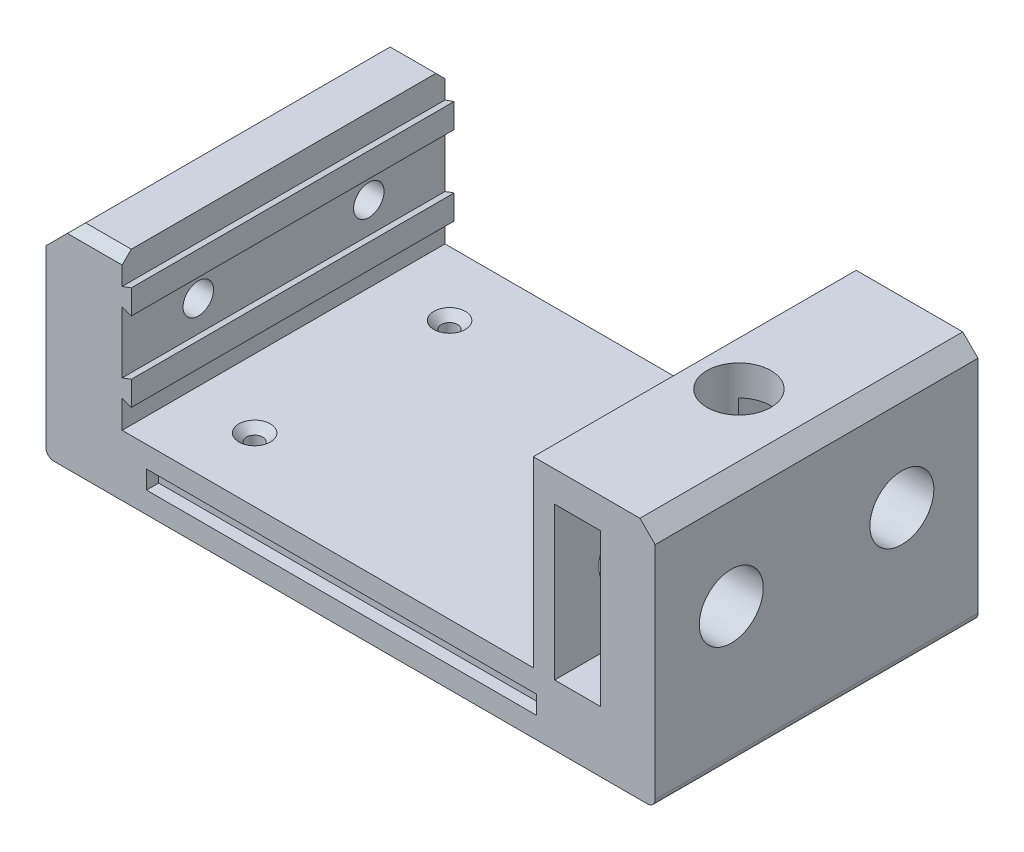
ISO-10303-21;
HEADER;
FILE_DESCRIPTION(('STEP AP214'),'2;1');
FILE_NAME('part.step','',(''),(''),'','','');
FILE_SCHEMA(('AUTOMOTIVE_DESIGN { 1 0 10303 214 1 1 1 1 }'));
ENDSEC;
DATA;
#1=APPLICATION_CONTEXT('core data for automotive mechanical design processes');
#2=APPLICATION_PROTOCOL_DEFINITION('international standard','automotive_design',2000,#1);
#3=PRODUCT_CONTEXT('',#1,'mechanical');
#4=PRODUCT('Part','Part','',(#3));
#5=PRODUCT_RELATED_PRODUCT_CATEGORY('part','',(#4));
#6=PRODUCT_DEFINITION_FORMATION('','',#4);
#7=PRODUCT_DEFINITION_CONTEXT('part definition',#1,'design');
#8=PRODUCT_DEFINITION('design','',#6,#7);
#9=PRODUCT_DEFINITION_SHAPE('','',#8);
#10=(LENGTH_UNIT() NAMED_UNIT(*) SI_UNIT(.MILLI.,.METRE.));
#11=(NAMED_UNIT(*) PLANE_ANGLE_UNIT() SI_UNIT($,.RADIAN.));
#12=(NAMED_UNIT(*) SI_UNIT($,.STERADIAN.) SOLID_ANGLE_UNIT());
#13=UNCERTAINTY_MEASURE_WITH_UNIT(LENGTH_MEASURE(1.E-05),#10,'distance_accuracy_value','');
#14=(GEOMETRIC_REPRESENTATION_CONTEXT(3) GLOBAL_UNCERTAINTY_ASSIGNED_CONTEXT((#13)) GLOBAL_UNIT_ASSIGNED_CONTEXT((#10,
#11,#12)) REPRESENTATION_CONTEXT('',''));
#15=CARTESIAN_POINT('',(0.,0.,0.));
#16=DIRECTION('',(0.,0.,1.));
#17=DIRECTION('',(1.,0.,0.));
#18=AXIS2_PLACEMENT_3D('',#15,#16,#17);
#19=CARTESIAN_POINT('',(-67.5,0.,53.));
#20=DIRECTION('',(-1.,0.,0.));
#21=DIRECTION('',(0.,-1.,0.));
#22=AXIS2_PLACEMENT_3D('',#19,#20,#21);
#23=PLANE('',#22);
#24=CARTESIAN_POINT('',(-67.5,24.9999999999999,-28.));
#25=DIRECTION('',(1.,0.,0.));
#26=DIRECTION('',(0.,1.,0.));
#27=AXIS2_PLACEMENT_3D('',#24,#25,#26);
#28=CIRCLE('',#27,5.);
#29=CARTESIAN_POINT('',(-67.5,29.9999999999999,-28.));
#30=VERTEX_POINT('',#29);
#31=EDGE_CURVE('E409',#30,#30,#28,.T.);
#32=ORIENTED_EDGE('',*,*,#31,.F.);
#33=EDGE_LOOP('',(#32));
#34=FACE_BOUND('',#33,.T.);
#35=CARTESIAN_POINT('',(-67.5,24.9999999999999,28.));
#36=DIRECTION('',(1.,0.,0.));
#37=DIRECTION('',(0.,1.,0.));
#38=AXIS2_PLACEMENT_3D('',#35,#36,#37);
#39=CIRCLE('',#38,5.);
#40=CARTESIAN_POINT('',(-67.5,29.9999999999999,28.));
#41=VERTEX_POINT('',#40);
#42=EDGE_CURVE('E419',#41,#41,#39,.T.);
#43=ORIENTED_EDGE('',*,*,#42,.F.);
#44=EDGE_LOOP('',(#43));
#45=FACE_BOUND('',#44,.T.);
#46=DIRECTION('',(0.,1.,0.));
#47=VECTOR('',#46,1.);
#48=CARTESIAN_POINT('',(-67.5,0.,53.));
#49=LINE('',#48,#47);
#50=CARTESIAN_POINT('',(-67.5,14.9080892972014,53.));
#51=VERTEX_POINT('',#50);
#52=CARTESIAN_POINT('',(-67.5,35.0919107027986,53.));
#53=VERTEX_POINT('',#52);
#54=EDGE_CURVE('E535',#51,#53,#49,.T.);
#55=ORIENTED_EDGE('',*,*,#54,.F.);
#56=DIRECTION('',(0.,0.,1.));
#57=VECTOR('',#56,1.);
#58=CARTESIAN_POINT('',(-67.5,14.9080892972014,-61.5440037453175));
#59=LINE('',#58,#57);
#60=CARTESIAN_POINT('',(-67.5,14.9080892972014,-53.));
#61=VERTEX_POINT('',#60);
#62=EDGE_CURVE('E299',#61,#51,#59,.T.);
#63=ORIENTED_EDGE('',*,*,#62,.F.);
#64=DIRECTION('',(0.,1.,0.));
#65=VECTOR('',#64,1.);
#66=CARTESIAN_POINT('',(-67.5,0.,-53.));
#67=LINE('',#66,#65);
#68=CARTESIAN_POINT('',(-67.5,35.0919107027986,-53.));
#69=VERTEX_POINT('',#68);
#70=EDGE_CURVE('E295',#61,#69,#67,.T.);
#71=ORIENTED_EDGE('',*,*,#70,.T.);
#72=DIRECTION('',(0.,0.,1.));
#73=VECTOR('',#72,1.);
#74=CARTESIAN_POINT('',(-67.5,35.0919107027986,-61.5440037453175));
#75=LINE('',#74,#73);
#76=EDGE_CURVE('E347',#69,#53,#75,.T.);
#77=ORIENTED_EDGE('',*,*,#76,.T.);
#78=EDGE_LOOP('',(#55,#63,#71,#77));
#79=FACE_BOUND('',#78,.T.);
#80=ADVANCED_FACE('F38',(#34,#45,#79),#23,.F.);
#81=CARTESIAN_POINT('',(-67.5,0.,-53.));
#82=VERTEX_POINT('',#81);
#83=CARTESIAN_POINT('',(-67.5,9.09191070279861,-53.));
#84=VERTEX_POINT('',#83);
#85=EDGE_CURVE('E550',#82,#84,#67,.T.);
#86=ORIENTED_EDGE('',*,*,#85,.T.);
#87=DIRECTION('',(0.,0.,1.));
#88=VECTOR('',#87,1.);
#89=CARTESIAN_POINT('',(-67.5,9.09191070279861,-61.5440037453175));
#90=LINE('',#89,#88);
#91=CARTESIAN_POINT('',(-67.5,9.09191070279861,53.));
#92=VERTEX_POINT('',#91);
#93=EDGE_CURVE('E320',#84,#92,#90,.T.);
#94=ORIENTED_EDGE('',*,*,#93,.T.);
#95=CARTESIAN_POINT('',(-67.5,0.,53.));
#96=VERTEX_POINT('',#95);
#97=EDGE_CURVE('E531',#96,#92,#49,.T.);
#98=ORIENTED_EDGE('',*,*,#97,.F.);
#99=DIRECTION('',(0.,0.,-1.));
#100=VECTOR('',#99,1.);
#101=CARTESIAN_POINT('',(-67.5,0.,53.));
#102=LINE('',#101,#100);
#103=EDGE_CURVE('E564',#96,#82,#102,.T.);
#104=ORIENTED_EDGE('',*,*,#103,.T.);
#105=EDGE_LOOP('',(#86,#94,#98,#104));
#106=FACE_BOUND('',#105,.T.);
#107=ADVANCED_FACE('F713',(#106),#23,.F.);
#108=CARTESIAN_POINT('',(0.,0.,-53.));
#109=DIRECTION('',(0.,0.,-1.));
#110=DIRECTION('',(-1.,0.,0.));
#111=AXIS2_PLACEMENT_3D('',#108,#109,#110);
#112=PLANE('',#111);
#113=DIRECTION('',(0.,1.,0.));
#114=VECTOR('',#113,1.);
#115=CARTESIAN_POINT('',(89.5,0.,-53.));
#116=LINE('',#115,#114);
#117=CARTESIAN_POINT('',(89.5,0.,-53.));
#118=VERTEX_POINT('',#117);
#119=CARTESIAN_POINT('',(89.5,50.,-53.));
#120=VERTEX_POINT('',#119);
#121=EDGE_CURVE('E459',#118,#120,#116,.T.);
#122=ORIENTED_EDGE('',*,*,#121,.T.);
#123=DIRECTION('',(-1.,0.,0.));
#124=VECTOR('',#123,1.);
#125=CARTESIAN_POINT('',(74.5,50.,-53.));
#126=LINE('',#125,#124);
#127=CARTESIAN_POINT('',(74.5,50.,-53.));
#128=VERTEX_POINT('',#127);
#129=EDGE_CURVE('E462',#120,#128,#126,.T.);
#130=ORIENTED_EDGE('',*,*,#129,.T.);
#131=DIRECTION('',(0.,-1.,0.));
#132=VECTOR('',#131,1.);
#133=CARTESIAN_POINT('',(74.5,0.,-53.));
#134=LINE('',#133,#132);
#135=CARTESIAN_POINT('',(74.5,0.,-53.));
#136=VERTEX_POINT('',#135);
#137=EDGE_CURVE('E466',#128,#136,#134,.T.);
#138=ORIENTED_EDGE('',*,*,#137,.T.);
#139=DIRECTION('',(1.,0.,0.));
#140=VECTOR('',#139,1.);
#141=CARTESIAN_POINT('',(74.5,0.,-53.));
#142=LINE('',#141,#140);
#143=EDGE_CURVE('E469',#136,#118,#142,.T.);
#144=ORIENTED_EDGE('',*,*,#143,.T.);
#145=EDGE_LOOP('',(#122,#130,#138,#144));
#146=FACE_BOUND('',#145,.T.);
#147=DIRECTION('',(0.,1.,0.));
#148=VECTOR('',#147,1.);
#149=CARTESIAN_POINT('',(107.5,60.,-53.));
#150=LINE('',#149,#148);
#151=CARTESIAN_POINT('',(107.5,-17.5,-53.));
#152=VERTEX_POINT('',#151);
#153=CARTESIAN_POINT('',(107.5,55.,-53.));
#154=VERTEX_POINT('',#153);
#155=EDGE_CURVE('E541',#152,#154,#150,.T.);
#156=ORIENTED_EDGE('',*,*,#155,.F.);
#157=CARTESIAN_POINT('',(105.,-17.5,-53.));
#158=DIRECTION('',(0.,0.,-1.));
#159=DIRECTION('',(-1.,0.,0.));
#160=AXIS2_PLACEMENT_3D('',#157,#158,#159);
#161=CIRCLE('',#160,2.5);
#162=CARTESIAN_POINT('',(105.,-20.,-53.));
#163=VERTEX_POINT('',#162);
#164=EDGE_CURVE('E617',#152,#163,#161,.T.);
#165=ORIENTED_EDGE('',*,*,#164,.T.);
#166=DIRECTION('',(1.,0.,0.));
#167=VECTOR('',#166,1.);
#168=CARTESIAN_POINT('',(-92.5,-20.,-53.));
#169=LINE('',#168,#167);
#170=CARTESIAN_POINT('',(-90.,-20.,-53.));
#171=VERTEX_POINT('',#170);
#172=EDGE_CURVE('E516',#171,#163,#169,.T.);
#173=ORIENTED_EDGE('',*,*,#172,.F.);
#174=CARTESIAN_POINT('',(-90.,-17.5,-53.));
#175=DIRECTION('',(0.,0.,-1.));
#176=DIRECTION('',(-1.,0.,0.));
#177=AXIS2_PLACEMENT_3D('',#174,#175,#176);
#178=CIRCLE('',#177,2.5);
#179=CARTESIAN_POINT('',(-92.5,-17.5,-53.));
#180=VERTEX_POINT('',#179);
#181=EDGE_CURVE('E615',#171,#180,#178,.T.);
#182=ORIENTED_EDGE('',*,*,#181,.T.);
#183=DIRECTION('',(0.,-1.,0.));
#184=VECTOR('',#183,1.);
#185=CARTESIAN_POINT('',(-92.5,40.,-53.));
#186=LINE('',#185,#184);
#187=CARTESIAN_POINT('',(-92.5,40.,-53.));
#188=VERTEX_POINT('',#187);
#189=EDGE_CURVE('E522',#188,#180,#186,.T.);
#190=ORIENTED_EDGE('',*,*,#189,.F.);
#191=DIRECTION('',(-0.707106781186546,-0.707106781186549,0.));
#192=VECTOR('',#191,1.);
#193=CARTESIAN_POINT('',(-82.5,50.,-53.));
#194=LINE('',#193,#192);
#195=CARTESIAN_POINT('',(-85.5,47.,-53.));
#196=VERTEX_POINT('',#195);
#197=EDGE_CURVE('E553',#196,#188,#194,.T.);
#198=ORIENTED_EDGE('',*,*,#197,.F.);
#199=DIRECTION('',(1.,0.,0.));
#200=VECTOR('',#199,1.);
#201=CARTESIAN_POINT('',(-67.5,47.,-53.));
#202=LINE('',#201,#200);
#203=CARTESIAN_POINT('',(-67.5,47.,-53.));
#204=VERTEX_POINT('',#203);
#205=EDGE_CURVE('E603',#196,#204,#202,.T.);
#206=ORIENTED_EDGE('',*,*,#205,.T.);
#207=CARTESIAN_POINT('',(-67.5,40.9080892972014,-53.));
#208=VERTEX_POINT('',#207);
#209=EDGE_CURVE('E549',#208,#204,#67,.T.);
#210=ORIENTED_EDGE('',*,*,#209,.F.);
#211=DIRECTION('',(-0.939692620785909,-0.342020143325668,0.));
#212=VECTOR('',#211,1.);
#213=CARTESIAN_POINT('',(-67.5,40.9080892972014,-53.));
#214=LINE('',#213,#212);
#215=CARTESIAN_POINT('',(-64.5,42.,-53.));
#216=VERTEX_POINT('',#215);
#217=EDGE_CURVE('E338',#216,#208,#214,.T.);
#218=ORIENTED_EDGE('',*,*,#217,.F.);
#219=DIRECTION('',(0.,1.,0.));
#220=VECTOR('',#219,1.);
#221=CARTESIAN_POINT('',(-64.5,42.,-53.));
#222=LINE('',#221,#220);
#223=CARTESIAN_POINT('',(-64.5,34.,-53.));
#224=VERTEX_POINT('',#223);
#225=EDGE_CURVE('E342',#224,#216,#222,.T.);
#226=ORIENTED_EDGE('',*,*,#225,.F.);
#227=DIRECTION('',(0.939692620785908,-0.34202014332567,0.));
#228=VECTOR('',#227,1.);
#229=CARTESIAN_POINT('',(-67.5,35.0919107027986,-53.));
#230=LINE('',#229,#228);
#231=EDGE_CURVE('E329',#69,#224,#230,.T.);
#232=ORIENTED_EDGE('',*,*,#231,.F.);
#233=ORIENTED_EDGE('',*,*,#70,.F.);
#234=DIRECTION('',(-0.939692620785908,-0.342020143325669,0.));
#235=VECTOR('',#234,1.);
#236=CARTESIAN_POINT('',(-67.5,14.9080892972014,-53.));
#237=LINE('',#236,#235);
#238=CARTESIAN_POINT('',(-64.5,16.,-53.));
#239=VERTEX_POINT('',#238);
#240=EDGE_CURVE('E286',#239,#61,#237,.T.);
#241=ORIENTED_EDGE('',*,*,#240,.F.);
#242=DIRECTION('',(0.,1.,0.));
#243=VECTOR('',#242,1.);
#244=CARTESIAN_POINT('',(-64.5,8.,-53.));
#245=LINE('',#244,#243);
#246=CARTESIAN_POINT('',(-64.5,8.,-53.));
#247=VERTEX_POINT('',#246);
#248=EDGE_CURVE('E292',#247,#239,#245,.T.);
#249=ORIENTED_EDGE('',*,*,#248,.F.);
#250=DIRECTION('',(0.939692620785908,-0.342020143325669,0.));
#251=VECTOR('',#250,1.);
#252=CARTESIAN_POINT('',(-67.5,9.09191070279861,-53.));
#253=LINE('',#252,#251);
#254=EDGE_CURVE('E319',#84,#247,#253,.T.);
#255=ORIENTED_EDGE('',*,*,#254,.F.);
#256=ORIENTED_EDGE('',*,*,#85,.F.);
#257=DIRECTION('',(-1.,0.,0.));
#258=VECTOR('',#257,1.);
#259=CARTESIAN_POINT('',(-67.5,0.,-53.));
#260=LINE('',#259,#258);
#261=CARTESIAN_POINT('',(67.5,0.,-53.));
#262=VERTEX_POINT('',#261);
#263=EDGE_CURVE('E547',#262,#82,#260,.T.);
#264=ORIENTED_EDGE('',*,*,#263,.F.);
#265=DIRECTION('',(0.,-1.,0.));
#266=VECTOR('',#265,1.);
#267=CARTESIAN_POINT('',(67.5,0.,-53.));
#268=LINE('',#267,#266);
#269=CARTESIAN_POINT('',(67.5,60.,-53.));
#270=VERTEX_POINT('',#269);
#271=EDGE_CURVE('E545',#270,#262,#268,.T.);
#272=ORIENTED_EDGE('',*,*,#271,.F.);
#273=DIRECTION('',(-1.,0.,0.));
#274=VECTOR('',#273,1.);
#275=CARTESIAN_POINT('',(67.5,60.,-53.));
#276=LINE('',#275,#274);
#277=CARTESIAN_POINT('',(102.5,60.,-53.));
#278=VERTEX_POINT('',#277);
#279=EDGE_CURVE('E543',#278,#270,#276,.T.);
#280=ORIENTED_EDGE('',*,*,#279,.F.);
#281=DIRECTION('',(-0.707106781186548,0.707106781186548,0.));
#282=VECTOR('',#281,1.);
#283=CARTESIAN_POINT('',(81.25,81.25,-53.));
#284=LINE('',#283,#282);
#285=EDGE_CURVE('E586',#278,#154,#284,.F.);
#286=ORIENTED_EDGE('',*,*,#285,.T.);
#287=EDGE_LOOP('',(#156,#165,#173,#182,#190,#198,#206,#210,#218,#226,#232,#233,#241,#249,#255,
#256,#264,#272,#280,#286));
#288=FACE_BOUND('',#287,.T.);
#289=DIRECTION('',(1.,0.,0.));
#290=VECTOR('',#289,1.);
#291=CARTESIAN_POINT('',(-59.5,-13.,-53.));
#292=LINE('',#291,#290);
#293=CARTESIAN_POINT('',(-59.5,-13.,-53.));
#294=VERTEX_POINT('',#293);
#295=CARTESIAN_POINT('',(68.5,-13.,-53.));
#296=VERTEX_POINT('',#295);
#297=EDGE_CURVE('E366',#294,#296,#292,.T.);
#298=ORIENTED_EDGE('',*,*,#297,.T.);
#299=DIRECTION('',(0.,1.,0.));
#300=VECTOR('',#299,1.);
#301=CARTESIAN_POINT('',(68.5,-13.,-53.));
#302=LINE('',#301,#300);
#303=CARTESIAN_POINT('',(68.5,-6.99999999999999,-53.));
#304=VERTEX_POINT('',#303);
#305=EDGE_CURVE('E352',#296,#304,#302,.T.);
#306=ORIENTED_EDGE('',*,*,#305,.T.);
#307=DIRECTION('',(-1.,0.,0.));
#308=VECTOR('',#307,1.);
#309=CARTESIAN_POINT('',(-59.5,-6.99999999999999,-53.));
#310=LINE('',#309,#308);
#311=CARTESIAN_POINT('',(-59.5,-6.99999999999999,-53.));
#312=VERTEX_POINT('',#311);
#313=EDGE_CURVE('E357',#304,#312,#310,.T.);
#314=ORIENTED_EDGE('',*,*,#313,.T.);
#315=DIRECTION('',(0.,-1.,0.));
#316=VECTOR('',#315,1.);
#317=CARTESIAN_POINT('',(-59.5,-13.,-53.));
#318=LINE('',#317,#316);
#319=EDGE_CURVE('E369',#312,#294,#318,.T.);
#320=ORIENTED_EDGE('',*,*,#319,.T.);
#321=EDGE_LOOP('',(#298,#306,#314,#320));
#322=FACE_BOUND('',#321,.T.);
#323=ADVANCED_FACE('F289',(#146,#288,#322),#112,.T.);
#324=CARTESIAN_POINT('',(74.5,0.,-53.));
#325=DIRECTION('',(0.,-1.,0.));
#326=DIRECTION('',(0.,0.,-1.));
#327=AXIS2_PLACEMENT_3D('',#324,#325,#326);
#328=PLANE('',#327);
#329=DIRECTION('',(0.,0.,1.));
#330=VECTOR('',#329,1.);
#331=CARTESIAN_POINT('',(89.5,0.,-53.));
#332=LINE('',#331,#330);
#333=CARTESIAN_POINT('',(89.5,0.,7.34846922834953));
#334=VERTEX_POINT('',#333);
#335=CARTESIAN_POINT('',(89.5,0.,53.));
#336=VERTEX_POINT('',#335);
#337=EDGE_CURVE('E487',#334,#336,#332,.T.);
#338=ORIENTED_EDGE('',*,*,#337,.F.);
#339=CARTESIAN_POINT('',(82.,0.,0.));
#340=DIRECTION('',(0.,1.,0.));
#341=DIRECTION('',(0.,0.,1.));
#342=AXIS2_PLACEMENT_3D('',#339,#340,#341);
#343=CIRCLE('',#342,10.5);
#344=CARTESIAN_POINT('',(74.5,0.,7.34846922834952));
#345=VERTEX_POINT('',#344);
#346=EDGE_CURVE('E437',#345,#334,#343,.T.);
#347=ORIENTED_EDGE('',*,*,#346,.F.);
#348=DIRECTION('',(0.,0.,1.));
#349=VECTOR('',#348,1.);
#350=CARTESIAN_POINT('',(74.5,0.,-53.));
#351=LINE('',#350,#349);
#352=CARTESIAN_POINT('',(74.5,0.,53.));
#353=VERTEX_POINT('',#352);
#354=EDGE_CURVE('E491',#345,#353,#351,.T.);
#355=ORIENTED_EDGE('',*,*,#354,.T.);
#356=DIRECTION('',(1.,0.,0.));
#357=VECTOR('',#356,1.);
#358=CARTESIAN_POINT('',(74.5,0.,53.));
#359=LINE('',#358,#357);
#360=EDGE_CURVE('E463',#353,#336,#359,.T.);
#361=ORIENTED_EDGE('',*,*,#360,.T.);
#362=EDGE_LOOP('',(#338,#347,#355,#361));
#363=FACE_BOUND('',#362,.T.);
#364=ADVANCED_FACE('F872',(#363),#328,.F.);
#365=CARTESIAN_POINT('',(89.5,0.,-53.));
#366=DIRECTION('',(1.,0.,0.));
#367=DIRECTION('',(0.,0.,-1.));
#368=AXIS2_PLACEMENT_3D('',#365,#366,#367);
#369=PLANE('',#368);
#370=CARTESIAN_POINT('',(89.5,25.,-28.));
#371=DIRECTION('',(1.,0.,0.));
#372=DIRECTION('',(0.,0.,-1.));
#373=AXIS2_PLACEMENT_3D('',#370,#371,#372);
#374=CIRCLE('',#373,10.5);
#375=CARTESIAN_POINT('',(89.5,14.5,-28.));
#376=VERTEX_POINT('',#375);
#377=EDGE_CURVE('E503',#376,#376,#374,.F.);
#378=ORIENTED_EDGE('',*,*,#377,.F.);
#379=EDGE_LOOP('',(#378));
#380=FACE_BOUND('',#379,.T.);
#381=CARTESIAN_POINT('',(89.5,0.,-7.34846922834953));
#382=VERTEX_POINT('',#381);
#383=EDGE_CURVE('E483',#118,#382,#332,.T.);
#384=ORIENTED_EDGE('',*,*,#383,.T.);
#385=DIRECTION('',(0.,1.,0.));
#386=VECTOR('',#385,1.);
#387=CARTESIAN_POINT('',(89.5,-29.6984848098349,-7.34846922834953));
#388=LINE('',#387,#386);
#389=CARTESIAN_POINT('',(89.5,50.,-7.34846922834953));
#390=VERTEX_POINT('',#389);
#391=EDGE_CURVE('E455',#382,#390,#388,.T.);
#392=ORIENTED_EDGE('',*,*,#391,.T.);
#393=DIRECTION('',(0.,0.,1.));
#394=VECTOR('',#393,1.);
#395=CARTESIAN_POINT('',(89.5,50.,-53.));
#396=LINE('',#395,#394);
#397=EDGE_CURVE('E496',#120,#390,#396,.T.);
#398=ORIENTED_EDGE('',*,*,#397,.F.);
#399=ORIENTED_EDGE('',*,*,#121,.F.);
#400=EDGE_LOOP('',(#384,#392,#398,#399));
#401=FACE_BOUND('',#400,.T.);
#402=ADVANCED_FACE('F886',(#380,#401),#369,.F.);
#403=CARTESIAN_POINT('',(74.5,0.,-53.));
#404=DIRECTION('',(-1.,0.,0.));
#405=DIRECTION('',(0.,0.,1.));
#406=AXIS2_PLACEMENT_3D('',#403,#404,#405);
#407=PLANE('',#406);
#408=CARTESIAN_POINT('',(74.5,25.,28.));
#409=DIRECTION('',(-1.,0.,0.));
#410=DIRECTION('',(0.,0.,1.));
#411=AXIS2_PLACEMENT_3D('',#408,#409,#410);
#412=CIRCLE('',#411,10.5);
#413=CARTESIAN_POINT('',(74.5,14.5,28.));
#414=VERTEX_POINT('',#413);
#415=EDGE_CURVE('E486',#414,#414,#412,.F.);
#416=ORIENTED_EDGE('',*,*,#415,.F.);
#417=EDGE_LOOP('',(#416));
#418=FACE_BOUND('',#417,.T.);
#419=ORIENTED_EDGE('',*,*,#354,.F.);
#420=DIRECTION('',(0.,1.,0.));
#421=VECTOR('',#420,1.);
#422=CARTESIAN_POINT('',(74.5,-29.6984848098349,7.34846922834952));
#423=LINE('',#422,#421);
#424=CARTESIAN_POINT('',(74.5,50.,7.34846922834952));
#425=VERTEX_POINT('',#424);
#426=EDGE_CURVE('E446',#345,#425,#423,.T.);
#427=ORIENTED_EDGE('',*,*,#426,.T.);
#428=DIRECTION('',(0.,0.,1.));
#429=VECTOR('',#428,1.);
#430=CARTESIAN_POINT('',(74.5,50.,-53.));
#431=LINE('',#430,#429);
#432=CARTESIAN_POINT('',(74.5,50.,53.));
#433=VERTEX_POINT('',#432);
#434=EDGE_CURVE('E495',#425,#433,#431,.T.);
#435=ORIENTED_EDGE('',*,*,#434,.T.);
#436=DIRECTION('',(0.,-1.,0.));
#437=VECTOR('',#436,1.);
#438=CARTESIAN_POINT('',(74.5,0.,53.));
#439=LINE('',#438,#437);
#440=EDGE_CURVE('E478',#433,#353,#439,.T.);
#441=ORIENTED_EDGE('',*,*,#440,.T.);
#442=EDGE_LOOP('',(#419,#427,#435,#441));
#443=FACE_BOUND('',#442,.T.);
#444=ADVANCED_FACE('F877',(#418,#443),#407,.F.);
#445=CARTESIAN_POINT('',(74.5,50.,-53.));
#446=DIRECTION('',(0.,1.,0.));
#447=DIRECTION('',(0.,0.,1.));
#448=AXIS2_PLACEMENT_3D('',#445,#446,#447);
#449=PLANE('',#448);
#450=ORIENTED_EDGE('',*,*,#397,.T.);
#451=CARTESIAN_POINT('',(82.,50.,0.));
#452=DIRECTION('',(0.,1.,0.));
#453=DIRECTION('',(0.,0.,1.));
#454=AXIS2_PLACEMENT_3D('',#451,#452,#453);
#455=CIRCLE('',#454,10.5);
#456=CARTESIAN_POINT('',(74.5,50.,-7.34846922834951));
#457=VERTEX_POINT('',#456);
#458=EDGE_CURVE('E580',#390,#457,#455,.T.);
#459=ORIENTED_EDGE('',*,*,#458,.T.);
#460=EDGE_CURVE('E492',#128,#457,#431,.T.);
#461=ORIENTED_EDGE('',*,*,#460,.F.);
#462=ORIENTED_EDGE('',*,*,#129,.F.);
#463=EDGE_LOOP('',(#450,#459,#461,#462));
#464=FACE_BOUND('',#463,.T.);
#465=ADVANCED_FACE('F881',(#464),#449,.F.);
#466=CARTESIAN_POINT('',(107.5,25.,-28.));
#467=DIRECTION('',(-1.,0.,0.));
#468=DIRECTION('',(0.,-1.,0.));
#469=AXIS2_PLACEMENT_3D('',#466,#467,#468);
#470=CYLINDRICAL_SURFACE('',#469,10.5);
#471=CARTESIAN_POINT('',(107.5,25.,-28.));
#472=DIRECTION('',(-1.,0.,0.));
#473=DIRECTION('',(0.,-1.,0.));
#474=AXIS2_PLACEMENT_3D('',#471,#472,#473);
#475=CIRCLE('',#474,10.5);
#476=CARTESIAN_POINT('',(107.5,14.5,-28.));
#477=VERTEX_POINT('',#476);
#478=EDGE_CURVE('E513',#477,#477,#475,.T.);
#479=CARTESIAN_POINT('',(89.5,14.5,-28.));
#480=CARTESIAN_POINT('',(89.6875,14.5,-28.));
#481=CARTESIAN_POINT('',(89.875,14.5,-28.));
#482=CARTESIAN_POINT('',(90.25,14.5,-28.));
#483=CARTESIAN_POINT('',(90.4375,14.5,-28.));
#484=CARTESIAN_POINT('',(90.8125,14.5,-28.));
#485=CARTESIAN_POINT('',(91.,14.5,-28.));
#486=CARTESIAN_POINT('',(91.375,14.5,-28.));
#487=CARTESIAN_POINT('',(91.5625,14.5,-28.));
#488=CARTESIAN_POINT('',(91.9375,14.5,-28.));
#489=CARTESIAN_POINT('',(92.125,14.5,-28.));
#490=CARTESIAN_POINT('',(92.5,14.5,-28.));
#491=CARTESIAN_POINT('',(92.6875,14.5,-28.));
#492=CARTESIAN_POINT('',(93.0625,14.5,-28.));
#493=CARTESIAN_POINT('',(93.25,14.5,-28.));
#494=CARTESIAN_POINT('',(93.625,14.5,-28.));
#495=CARTESIAN_POINT('',(93.8125,14.5,-28.));
#496=CARTESIAN_POINT('',(94.1875,14.5,-28.));
#497=CARTESIAN_POINT('',(94.375,14.5,-28.));
#498=CARTESIAN_POINT('',(94.75,14.5,-28.));
#499=CARTESIAN_POINT('',(94.9375,14.5,-28.));
#500=CARTESIAN_POINT('',(95.3125,14.5,-28.));
#501=CARTESIAN_POINT('',(95.5,14.5,-28.));
#502=CARTESIAN_POINT('',(95.875,14.5,-28.));
#503=CARTESIAN_POINT('',(96.0625,14.5,-28.));
#504=CARTESIAN_POINT('',(96.4375,14.5,-28.));
#505=CARTESIAN_POINT('',(96.625,14.5,-28.));
#506=CARTESIAN_POINT('',(97.,14.5,-28.));
#507=CARTESIAN_POINT('',(97.1875,14.5,-28.));
#508=CARTESIAN_POINT('',(97.5625,14.5,-28.));
#509=CARTESIAN_POINT('',(97.75,14.5,-28.));
#510=CARTESIAN_POINT('',(98.125,14.5,-28.));
#511=CARTESIAN_POINT('',(98.3125,14.5,-28.));
#512=CARTESIAN_POINT('',(98.6875,14.5,-28.));
#513=CARTESIAN_POINT('',(98.875,14.5,-28.));
#514=CARTESIAN_POINT('',(99.25,14.5,-28.));
#515=CARTESIAN_POINT('',(99.4375,14.5,-28.));
#516=CARTESIAN_POINT('',(99.8125,14.5,-28.));
#517=CARTESIAN_POINT('',(100.,14.5,-28.));
#518=CARTESIAN_POINT('',(100.375,14.5,-28.));
#519=CARTESIAN_POINT('',(100.5625,14.5,-28.));
#520=CARTESIAN_POINT('',(100.9375,14.5,-28.));
#521=CARTESIAN_POINT('',(101.125,14.5,-28.));
#522=CARTESIAN_POINT('',(101.5,14.5,-28.));
#523=CARTESIAN_POINT('',(101.6875,14.5,-28.));
#524=CARTESIAN_POINT('',(102.0625,14.5,-28.));
#525=CARTESIAN_POINT('',(102.25,14.5,-28.));
#526=CARTESIAN_POINT('',(102.625,14.5,-28.));
#527=CARTESIAN_POINT('',(102.8125,14.5,-28.));
#528=CARTESIAN_POINT('',(103.1875,14.5,-28.));
#529=CARTESIAN_POINT('',(103.375,14.5,-28.));
#530=CARTESIAN_POINT('',(103.75,14.5,-28.));
#531=CARTESIAN_POINT('',(103.9375,14.5,-28.));
#532=CARTESIAN_POINT('',(104.3125,14.5,-28.));
#533=CARTESIAN_POINT('',(104.5,14.5,-28.));
#534=CARTESIAN_POINT('',(104.875,14.5,-28.));
#535=CARTESIAN_POINT('',(105.0625,14.5,-28.));
#536=CARTESIAN_POINT('',(105.4375,14.5,-28.));
#537=CARTESIAN_POINT('',(105.625,14.5,-28.));
#538=CARTESIAN_POINT('',(106.,14.5,-28.));
#539=CARTESIAN_POINT('',(106.1875,14.5,-28.));
#540=CARTESIAN_POINT('',(106.5625,14.5,-28.));
#541=CARTESIAN_POINT('',(106.75,14.5,-28.));
#542=CARTESIAN_POINT('',(107.125,14.5,-28.));
#543=CARTESIAN_POINT('',(107.3125,14.5,-28.));
#544=CARTESIAN_POINT('',(107.5,14.5,-28.));
#545=B_SPLINE_CURVE_WITH_KNOTS('',3,(#479,#480,#481,#482,#483,#484,#485,#486,#487,#488,#489,
#490,#491,#492,#493,#494,#495,#496,#497,#498,#499,#500,#501,#502,#503,#504,#505,#506,#507,#508,
#509,#510,#511,#512,#513,#514,#515,#516,#517,#518,#519,#520,#521,#522,#523,#524,#525,#526,#527,
#528,#529,#530,#531,#532,#533,#534,#535,#536,#537,#538,#539,#540,#541,#542,#543,#544),
.UNSPECIFIED.,.F.,.F.,(4,2,2,2,2,2,2,2,2,2,2,2,2,2,2,2,2,2,2,2,2,2,2,2,2,2,2,2,2,2,2,2,4),(0.,
0.562499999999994,1.125,1.68749999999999,2.25,2.8125,3.37499999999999,3.9375,4.49999999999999,
5.0625,5.62499999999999,6.1875,6.74999999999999,7.3125,7.87499999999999,8.4375,8.99999999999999,
9.5625,10.125,10.6875,11.25,11.8125,12.375,12.9375,13.5,14.0625,14.625,15.1875,15.75,16.3125,
16.875,17.4375,18.),.UNSPECIFIED.);
#546=EDGE_CURVE('BSEAM894',#376,#477,#545,.T.);
#547=ORIENTED_EDGE('',*,*,#377,.T.);
#548=ORIENTED_EDGE('',*,*,#478,.F.);
#549=ORIENTED_EDGE('',*,*,#546,.T.);
#550=ORIENTED_EDGE('',*,*,#546,.F.);
#551=EDGE_LOOP('',(#547,#549,#548,#550));
#552=FACE_BOUND('',#551,.T.);
#553=ADVANCED_FACE('F894',(#552),#470,.F.);
#554=CARTESIAN_POINT('',(107.5,25.,28.));
#555=DIRECTION('',(-1.,0.,0.));
#556=DIRECTION('',(0.,-1.,0.));
#557=AXIS2_PLACEMENT_3D('',#554,#555,#556);
#558=CYLINDRICAL_SURFACE('',#557,10.5);
#559=CARTESIAN_POINT('',(89.5,25.,28.));
#560=DIRECTION('',(1.,0.,0.));
#561=DIRECTION('',(0.,0.,-1.));
#562=AXIS2_PLACEMENT_3D('',#559,#560,#561);
#563=CIRCLE('',#562,10.5);
#564=CARTESIAN_POINT('',(89.5,14.5,28.));
#565=VERTEX_POINT('',#564);
#566=EDGE_CURVE('E502',#565,#565,#563,.F.);
#567=CARTESIAN_POINT('',(107.5,25.,28.));
#568=DIRECTION('',(-1.,0.,0.));
#569=DIRECTION('',(0.,1.,0.));
#570=AXIS2_PLACEMENT_3D('',#567,#568,#569);
#571=CIRCLE('',#570,10.5);
#572=CARTESIAN_POINT('',(107.5,14.5,28.));
#573=VERTEX_POINT('',#572);
#574=EDGE_CURVE('E507',#573,#573,#571,.T.);
#575=CARTESIAN_POINT('',(89.5,14.5,28.));
#576=CARTESIAN_POINT('',(89.6875,14.5,28.));
#577=CARTESIAN_POINT('',(89.875,14.5,28.));
#578=CARTESIAN_POINT('',(90.25,14.5,28.));
#579=CARTESIAN_POINT('',(90.4375,14.5,28.));
#580=CARTESIAN_POINT('',(90.8125,14.5,28.));
#581=CARTESIAN_POINT('',(91.,14.5,28.));
#582=CARTESIAN_POINT('',(91.375,14.5,28.));
#583=CARTESIAN_POINT('',(91.5625,14.5,28.));
#584=CARTESIAN_POINT('',(91.9375,14.5,28.));
#585=CARTESIAN_POINT('',(92.125,14.5,28.));
#586=CARTESIAN_POINT('',(92.5,14.5,28.));
#587=CARTESIAN_POINT('',(92.6875,14.5,28.));
#588=CARTESIAN_POINT('',(93.0625,14.5,28.));
#589=CARTESIAN_POINT('',(93.25,14.5,28.));
#590=CARTESIAN_POINT('',(93.625,14.5,28.));
#591=CARTESIAN_POINT('',(93.8125,14.5,28.));
#592=CARTESIAN_POINT('',(94.1875,14.5,28.));
#593=CARTESIAN_POINT('',(94.375,14.5,28.));
#594=CARTESIAN_POINT('',(94.75,14.5,28.));
#595=CARTESIAN_POINT('',(94.9375,14.5,28.));
#596=CARTESIAN_POINT('',(95.3125,14.5,28.));
#597=CARTESIAN_POINT('',(95.5,14.5,28.));
#598=CARTESIAN_POINT('',(95.875,14.5,28.));
#599=CARTESIAN_POINT('',(96.0625,14.5,28.));
#600=CARTESIAN_POINT('',(96.4375,14.5,28.));
#601=CARTESIAN_POINT('',(96.625,14.5,28.));
#602=CARTESIAN_POINT('',(97.,14.5,28.));
#603=CARTESIAN_POINT('',(97.1875,14.5,28.));
#604=CARTESIAN_POINT('',(97.5625,14.5,28.));
#605=CARTESIAN_POINT('',(97.75,14.5,28.));
#606=CARTESIAN_POINT('',(98.125,14.5,28.));
#607=CARTESIAN_POINT('',(98.3125,14.5,28.));
#608=CARTESIAN_POINT('',(98.6875,14.5,28.));
#609=CARTESIAN_POINT('',(98.875,14.5,28.));
#610=CARTESIAN_POINT('',(99.25,14.5,28.));
#611=CARTESIAN_POINT('',(99.4375,14.5,28.));
#612=CARTESIAN_POINT('',(99.8125,14.5,28.));
#613=CARTESIAN_POINT('',(100.,14.5,28.));
#614=CARTESIAN_POINT('',(100.375,14.5,28.));
#615=CARTESIAN_POINT('',(100.5625,14.5,28.));
#616=CARTESIAN_POINT('',(100.9375,14.5,28.));
#617=CARTESIAN_POINT('',(101.125,14.5,28.));
#618=CARTESIAN_POINT('',(101.5,14.5,28.));
#619=CARTESIAN_POINT('',(101.6875,14.5,28.));
#620=CARTESIAN_POINT('',(102.0625,14.5,28.));
#621=CARTESIAN_POINT('',(102.25,14.5,28.));
#622=CARTESIAN_POINT('',(102.625,14.5,28.));
#623=CARTESIAN_POINT('',(102.8125,14.5,28.));
#624=CARTESIAN_POINT('',(103.1875,14.5,28.));
#625=CARTESIAN_POINT('',(103.375,14.5,28.));
#626=CARTESIAN_POINT('',(103.75,14.5,28.));
#627=CARTESIAN_POINT('',(103.9375,14.5,28.));
#628=CARTESIAN_POINT('',(104.3125,14.5,28.));
#629=CARTESIAN_POINT('',(104.5,14.5,28.));
#630=CARTESIAN_POINT('',(104.875,14.5,28.));
#631=CARTESIAN_POINT('',(105.0625,14.5,28.));
#632=CARTESIAN_POINT('',(105.4375,14.5,28.));
#633=CARTESIAN_POINT('',(105.625,14.5,28.));
#634=CARTESIAN_POINT('',(106.,14.5,28.));
#635=CARTESIAN_POINT('',(106.1875,14.5,28.));
#636=CARTESIAN_POINT('',(106.5625,14.5,28.));
#637=CARTESIAN_POINT('',(106.75,14.5,28.));
#638=CARTESIAN_POINT('',(107.125,14.5,28.));
#639=CARTESIAN_POINT('',(107.3125,14.5,28.));
#640=CARTESIAN_POINT('',(107.5,14.5,28.));
#641=B_SPLINE_CURVE_WITH_KNOTS('',3,(#575,#576,#577,#578,#579,#580,#581,#582,#583,#584,#585,
#586,#587,#588,#589,#590,#591,#592,#593,#594,#595,#596,#597,#598,#599,#600,#601,#602,#603,#604,
#605,#606,#607,#608,#609,#610,#611,#612,#613,#614,#615,#616,#617,#618,#619,#620,#621,#622,#623,
#624,#625,#626,#627,#628,#629,#630,#631,#632,#633,#634,#635,#636,#637,#638,#639,#640),
.UNSPECIFIED.,.F.,.F.,(4,2,2,2,2,2,2,2,2,2,2,2,2,2,2,2,2,2,2,2,2,2,2,2,2,2,2,2,2,2,2,2,4),(0.,
0.562499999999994,1.125,1.68749999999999,2.25,2.8125,3.37499999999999,3.9375,4.49999999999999,
5.0625,5.62499999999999,6.1875,6.74999999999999,7.3125,7.87499999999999,8.4375,8.99999999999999,
9.5625,10.125,10.6875,11.25,11.8125,12.375,12.9375,13.5,14.0625,14.625,15.1875,15.75,16.3125,
16.875,17.4375,18.),.UNSPECIFIED.);
#642=EDGE_CURVE('BSEAM673',#565,#573,#641,.T.);
#643=ORIENTED_EDGE('',*,*,#566,.T.);
#644=ORIENTED_EDGE('',*,*,#574,.F.);
#645=ORIENTED_EDGE('',*,*,#642,.T.);
#646=ORIENTED_EDGE('',*,*,#642,.F.);
#647=EDGE_LOOP('',(#643,#645,#644,#646));
#648=FACE_BOUND('',#647,.T.);
#649=ADVANCED_FACE('F673',(#648),#558,.F.);
#650=CARTESIAN_POINT('',(-92.5,-20.,53.));
#651=DIRECTION('',(0.,1.,0.));
#652=DIRECTION('',(0.,0.,1.));
#653=AXIS2_PLACEMENT_3D('',#650,#651,#652);
#654=PLANE('',#653);
#655=CARTESIAN_POINT('',(45.,-20.,0.));
#656=DIRECTION('',(0.,1.,0.));
#657=DIRECTION('',(0.,0.,1.));
#658=AXIS2_PLACEMENT_3D('',#655,#656,#657);
#659=CIRCLE('',#658,4.67500000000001);
#660=CARTESIAN_POINT('',(45.,-20.,4.67500000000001));
#661=VERTEX_POINT('',#660);
#662=EDGE_CURVE('E652',#661,#661,#659,.T.);
#663=ORIENTED_EDGE('',*,*,#662,.T.);
#664=EDGE_LOOP('',(#663));
#665=FACE_BOUND('',#664,.T.);
#666=CARTESIAN_POINT('',(-45.,-20.,-32.));
#667=DIRECTION('',(0.,1.,0.));
#668=DIRECTION('',(0.,0.,1.));
#669=AXIS2_PLACEMENT_3D('',#666,#667,#668);
#670=CIRCLE('',#669,4.67500000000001);
#671=CARTESIAN_POINT('',(-45.,-20.,-27.325));
#672=VERTEX_POINT('',#671);
#673=EDGE_CURVE('E649',#672,#672,#670,.T.);
#674=ORIENTED_EDGE('',*,*,#673,.T.);
#675=EDGE_LOOP('',(#674));
#676=FACE_BOUND('',#675,.T.);
#677=CARTESIAN_POINT('',(-45.,-20.,32.));
#678=DIRECTION('',(0.,1.,0.));
#679=DIRECTION('',(0.,0.,1.));
#680=AXIS2_PLACEMENT_3D('',#677,#678,#679);
#681=CIRCLE('',#680,4.67500000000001);
#682=CARTESIAN_POINT('',(-45.,-20.,36.675));
#683=VERTEX_POINT('',#682);
#684=EDGE_CURVE('E646',#683,#683,#681,.T.);
#685=ORIENTED_EDGE('',*,*,#684,.T.);
#686=EDGE_LOOP('',(#685));
#687=FACE_BOUND('',#686,.T.);
#688=CARTESIAN_POINT('',(82.,-20.,0.));
#689=DIRECTION('',(0.,-1.,0.));
#690=DIRECTION('',(0.,0.,-1.));
#691=AXIS2_PLACEMENT_3D('',#688,#689,#690);
#692=CIRCLE('',#691,13.5);
#693=CARTESIAN_POINT('',(82.,-20.,-13.5));
#694=VERTEX_POINT('',#693);
#695=EDGE_CURVE('E425',#694,#694,#692,.T.);
#696=ORIENTED_EDGE('',*,*,#695,.F.);
#697=EDGE_LOOP('',(#696));
#698=FACE_BOUND('',#697,.T.);
#699=ORIENTED_EDGE('',*,*,#172,.T.);
#700=DIRECTION('',(0.,0.,-1.));
#701=VECTOR('',#700,1.);
#702=CARTESIAN_POINT('',(105.,-20.,53.));
#703=LINE('',#702,#701);
#704=CARTESIAN_POINT('',(105.,-20.,53.));
#705=VERTEX_POINT('',#704);
#706=EDGE_CURVE('E61',#163,#705,#703,.F.);
#707=ORIENTED_EDGE('',*,*,#706,.T.);
#708=DIRECTION('',(1.,0.,0.));
#709=VECTOR('',#708,1.);
#710=CARTESIAN_POINT('',(-92.5,-20.,53.));
#711=LINE('',#710,#709);
#712=CARTESIAN_POINT('',(-90.,-20.,53.));
#713=VERTEX_POINT('',#712);
#714=EDGE_CURVE('E519',#713,#705,#711,.T.);
#715=ORIENTED_EDGE('',*,*,#714,.F.);
#716=DIRECTION('',(0.,0.,-1.));
#717=VECTOR('',#716,1.);
#718=CARTESIAN_POINT('',(-90.,-20.,53.));
#719=LINE('',#718,#717);
#720=EDGE_CURVE('E619',#713,#171,#719,.T.);
#721=ORIENTED_EDGE('',*,*,#720,.T.);
#722=EDGE_LOOP('',(#699,#707,#715,#721));
#723=FACE_BOUND('',#722,.T.);
#724=ADVANCED_FACE('F669',(#665,#676,#687,#698,#723),#654,.F.);
#725=CARTESIAN_POINT('',(107.5,60.,53.));
#726=DIRECTION('',(-1.,0.,0.));
#727=DIRECTION('',(0.,0.,1.));
#728=AXIS2_PLACEMENT_3D('',#725,#726,#727);
#729=PLANE('',#728);
#730=ORIENTED_EDGE('',*,*,#574,.T.);
#731=EDGE_LOOP('',(#730));
#732=FACE_BOUND('',#731,.T.);
#733=ORIENTED_EDGE('',*,*,#478,.T.);
#734=EDGE_LOOP('',(#733));
#735=FACE_BOUND('',#734,.T.);
#736=DIRECTION('',(0.,1.,0.));
#737=VECTOR('',#736,1.);
#738=CARTESIAN_POINT('',(107.5,60.,53.));
#739=LINE('',#738,#737);
#740=CARTESIAN_POINT('',(107.5,-17.5,53.));
#741=VERTEX_POINT('',#740);
#742=CARTESIAN_POINT('',(107.5,55.,53.));
#743=VERTEX_POINT('',#742);
#744=EDGE_CURVE('E521',#741,#743,#739,.T.);
#745=ORIENTED_EDGE('',*,*,#744,.F.);
#746=DIRECTION('',(0.,0.,-1.));
#747=VECTOR('',#746,1.);
#748=CARTESIAN_POINT('',(107.5,-17.5,53.));
#749=LINE('',#748,#747);
#750=EDGE_CURVE('E612',#741,#152,#749,.T.);
#751=ORIENTED_EDGE('',*,*,#750,.T.);
#752=ORIENTED_EDGE('',*,*,#155,.T.);
#753=DIRECTION('',(0.,0.,1.));
#754=VECTOR('',#753,1.);
#755=CARTESIAN_POINT('',(107.5,55.,53.));
#756=LINE('',#755,#754);
#757=EDGE_CURVE('E589',#154,#743,#756,.T.);
#758=ORIENTED_EDGE('',*,*,#757,.T.);
#759=EDGE_LOOP('',(#745,#751,#752,#758));
#760=FACE_BOUND('',#759,.T.);
#761=ADVANCED_FACE('F672',(#732,#735,#760),#729,.F.);
#762=CARTESIAN_POINT('',(67.5,60.,53.));
#763=DIRECTION('',(0.,-1.,0.));
#764=DIRECTION('',(0.,0.,-1.));
#765=AXIS2_PLACEMENT_3D('',#762,#763,#764);
#766=PLANE('',#765);
#767=CARTESIAN_POINT('',(82.,60.,0.));
#768=DIRECTION('',(0.,1.,0.));
#769=DIRECTION('',(0.,0.,1.));
#770=AXIS2_PLACEMENT_3D('',#767,#768,#769);
#771=CIRCLE('',#770,10.5);
#772=CARTESIAN_POINT('',(82.,60.,10.5));
#773=VERTEX_POINT('',#772);
#774=EDGE_CURVE('E441',#773,#773,#771,.T.);
#775=ORIENTED_EDGE('',*,*,#774,.F.);
#776=EDGE_LOOP('',(#775));
#777=FACE_BOUND('',#776,.T.);
#778=DIRECTION('',(-1.,0.,0.));
#779=VECTOR('',#778,1.);
#780=CARTESIAN_POINT('',(67.5,60.,53.));
#781=LINE('',#780,#779);
#782=CARTESIAN_POINT('',(102.5,60.,53.));
#783=VERTEX_POINT('',#782);
#784=CARTESIAN_POINT('',(67.5,60.,53.));
#785=VERTEX_POINT('',#784);
#786=EDGE_CURVE('E524',#783,#785,#781,.T.);
#787=ORIENTED_EDGE('',*,*,#786,.F.);
#788=DIRECTION('',(0.,0.,-1.));
#789=VECTOR('',#788,1.);
#790=CARTESIAN_POINT('',(102.5,60.,53.));
#791=LINE('',#790,#789);
#792=EDGE_CURVE('E583',#783,#278,#791,.T.);
#793=ORIENTED_EDGE('',*,*,#792,.T.);
#794=ORIENTED_EDGE('',*,*,#279,.T.);
#795=DIRECTION('',(0.,0.,-1.));
#796=VECTOR('',#795,1.);
#797=CARTESIAN_POINT('',(67.5,60.,53.));
#798=LINE('',#797,#796);
#799=EDGE_CURVE('E570',#785,#270,#798,.T.);
#800=ORIENTED_EDGE('',*,*,#799,.F.);
#801=EDGE_LOOP('',(#787,#793,#794,#800));
#802=FACE_BOUND('',#801,.T.);
#803=ADVANCED_FACE('F697',(#777,#802),#766,.F.);
#804=CARTESIAN_POINT('',(67.5,0.,53.));
#805=DIRECTION('',(1.,0.,0.));
#806=DIRECTION('',(0.,0.,-1.));
#807=AXIS2_PLACEMENT_3D('',#804,#805,#806);
#808=PLANE('',#807);
#809=CARTESIAN_POINT('',(67.5,25.,28.));
#810=DIRECTION('',(-1.,0.,0.));
#811=DIRECTION('',(0.,1.,0.));
#812=AXIS2_PLACEMENT_3D('',#809,#810,#811);
#813=CIRCLE('',#812,10.5);
#814=CARTESIAN_POINT('',(67.5,14.5,28.));
#815=VERTEX_POINT('',#814);
#816=EDGE_CURVE('E506',#815,#815,#813,.T.);
#817=ORIENTED_EDGE('',*,*,#816,.F.);
#818=EDGE_LOOP('',(#817));
#819=FACE_BOUND('',#818,.T.);
#820=CARTESIAN_POINT('',(67.5,25.,-28.));
#821=DIRECTION('',(-1.,0.,0.));
#822=DIRECTION('',(0.,-1.,0.));
#823=AXIS2_PLACEMENT_3D('',#820,#821,#822);
#824=CIRCLE('',#823,10.5);
#825=CARTESIAN_POINT('',(67.5,14.5,-28.));
#826=VERTEX_POINT('',#825);
#827=EDGE_CURVE('E510',#826,#826,#824,.T.);
#828=ORIENTED_EDGE('',*,*,#827,.F.);
#829=EDGE_LOOP('',(#828));
#830=FACE_BOUND('',#829,.T.);
#831=ORIENTED_EDGE('',*,*,#271,.T.);
#832=DIRECTION('',(0.,0.,-1.));
#833=VECTOR('',#832,1.);
#834=CARTESIAN_POINT('',(67.5,0.,53.));
#835=LINE('',#834,#833);
#836=CARTESIAN_POINT('',(67.5,0.,53.));
#837=VERTEX_POINT('',#836);
#838=EDGE_CURVE('E567',#837,#262,#835,.T.);
#839=ORIENTED_EDGE('',*,*,#838,.F.);
#840=DIRECTION('',(0.,-1.,0.));
#841=VECTOR('',#840,1.);
#842=CARTESIAN_POINT('',(67.5,0.,53.));
#843=LINE('',#842,#841);
#844=EDGE_CURVE('E526',#785,#837,#843,.T.);
#845=ORIENTED_EDGE('',*,*,#844,.F.);
#846=ORIENTED_EDGE('',*,*,#799,.T.);
#847=EDGE_LOOP('',(#831,#839,#845,#846));
#848=FACE_BOUND('',#847,.T.);
#849=ADVANCED_FACE('F703',(#819,#830,#848),#808,.F.);
#850=CARTESIAN_POINT('',(-67.5,0.,53.));
#851=DIRECTION('',(0.,-1.,0.));
#852=DIRECTION('',(1.,0.,0.));
#853=AXIS2_PLACEMENT_3D('',#850,#851,#852);
#854=PLANE('',#853);
#855=CARTESIAN_POINT('',(45.,0.,0.));
#856=DIRECTION('',(0.,-1.,0.));
#857=DIRECTION('',(1.,0.,0.));
#858=AXIS2_PLACEMENT_3D('',#855,#856,#857);
#859=CIRCLE('',#858,5.17500000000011);
#860=CARTESIAN_POINT('',(50.1750000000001,0.,0.));
#861=VERTEX_POINT('',#860);
#862=EDGE_CURVE('E637',#861,#861,#859,.T.);
#863=ORIENTED_EDGE('',*,*,#862,.T.);
#864=EDGE_LOOP('',(#863));
#865=FACE_BOUND('',#864,.T.);
#866=CARTESIAN_POINT('',(-45.,0.,32.));
#867=DIRECTION('',(0.,-1.,0.));
#868=DIRECTION('',(1.,0.,0.));
#869=AXIS2_PLACEMENT_3D('',#866,#867,#868);
#870=CIRCLE('',#869,5.17500000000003);
#871=CARTESIAN_POINT('',(-39.825,0.,32.));
#872=VERTEX_POINT('',#871);
#873=EDGE_CURVE('E634',#872,#872,#870,.T.);
#874=ORIENTED_EDGE('',*,*,#873,.T.);
#875=EDGE_LOOP('',(#874));
#876=FACE_BOUND('',#875,.T.);
#877=CARTESIAN_POINT('',(-45.,0.,-32.));
#878=DIRECTION('',(0.,-1.,0.));
#879=DIRECTION('',(1.,0.,0.));
#880=AXIS2_PLACEMENT_3D('',#877,#878,#879);
#881=CIRCLE('',#880,5.17500000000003);
#882=CARTESIAN_POINT('',(-39.825,0.,-32.));
#883=VERTEX_POINT('',#882);
#884=EDGE_CURVE('E631',#883,#883,#881,.T.);
#885=ORIENTED_EDGE('',*,*,#884,.T.);
#886=EDGE_LOOP('',(#885));
#887=FACE_BOUND('',#886,.T.);
#888=ORIENTED_EDGE('',*,*,#263,.T.);
#889=ORIENTED_EDGE('',*,*,#103,.F.);
#890=DIRECTION('',(-1.,0.,0.));
#891=VECTOR('',#890,1.);
#892=CARTESIAN_POINT('',(-67.5,0.,53.));
#893=LINE('',#892,#891);
#894=EDGE_CURVE('E528',#837,#96,#893,.T.);
#895=ORIENTED_EDGE('',*,*,#894,.F.);
#896=ORIENTED_EDGE('',*,*,#838,.T.);
#897=EDGE_LOOP('',(#888,#889,#895,#896));
#898=FACE_BOUND('',#897,.T.);
#899=ADVANCED_FACE('F709',(#865,#876,#887,#898),#854,.F.);
#900=ORIENTED_EDGE('',*,*,#209,.T.);
#901=DIRECTION('',(0.,0.707106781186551,0.707106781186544));
#902=VECTOR('',#901,1.);
#903=CARTESIAN_POINT('',(-67.5,50.,-50.));
#904=LINE('',#903,#902);
#905=CARTESIAN_POINT('',(-67.5,50.,-50.));
#906=VERTEX_POINT('',#905);
#907=EDGE_CURVE('E607',#204,#906,#904,.T.);
#908=ORIENTED_EDGE('',*,*,#907,.T.);
#909=DIRECTION('',(0.,0.,-1.));
#910=VECTOR('',#909,1.);
#911=CARTESIAN_POINT('',(-67.5,50.,53.));
#912=LINE('',#911,#910);
#913=CARTESIAN_POINT('',(-67.5,50.,50.));
#914=VERTEX_POINT('',#913);
#915=EDGE_CURVE('E561',#914,#906,#912,.T.);
#916=ORIENTED_EDGE('',*,*,#915,.F.);
#917=DIRECTION('',(0.,0.707106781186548,-0.707106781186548));
#918=VECTOR('',#917,1.);
#919=CARTESIAN_POINT('',(-67.5,47.,53.));
#920=LINE('',#919,#918);
#921=CARTESIAN_POINT('',(-67.5,47.,53.));
#922=VERTEX_POINT('',#921);
#923=EDGE_CURVE('E605',#914,#922,#920,.F.);
#924=ORIENTED_EDGE('',*,*,#923,.T.);
#925=CARTESIAN_POINT('',(-67.5,40.9080892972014,53.));
#926=VERTEX_POINT('',#925);
#927=EDGE_CURVE('E530',#926,#922,#49,.T.);
#928=ORIENTED_EDGE('',*,*,#927,.F.);
#929=DIRECTION('',(0.,0.,1.));
#930=VECTOR('',#929,1.);
#931=CARTESIAN_POINT('',(-67.5,40.9080892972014,-61.5440037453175));
#932=LINE('',#931,#930);
#933=EDGE_CURVE('E340',#208,#926,#932,.T.);
#934=ORIENTED_EDGE('',*,*,#933,.F.);
#935=EDGE_LOOP('',(#900,#908,#916,#924,#928,#934));
#936=FACE_BOUND('',#935,.T.);
#937=ADVANCED_FACE('F765',(#936),#23,.F.);
#938=CARTESIAN_POINT('',(-67.5,50.,53.));
#939=DIRECTION('',(0.,-1.,0.));
#940=DIRECTION('',(0.,0.,-1.));
#941=AXIS2_PLACEMENT_3D('',#938,#939,#940);
#942=PLANE('',#941);
#943=ORIENTED_EDGE('',*,*,#915,.T.);
#944=DIRECTION('',(-1.,0.,0.));
#945=VECTOR('',#944,1.);
#946=CARTESIAN_POINT('',(-82.5,50.,-50.));
#947=LINE('',#946,#945);
#948=CARTESIAN_POINT('',(-82.5,50.,-50.));
#949=VERTEX_POINT('',#948);
#950=EDGE_CURVE('E596',#906,#949,#947,.T.);
#951=ORIENTED_EDGE('',*,*,#950,.T.);
#952=DIRECTION('',(0.,0.,-1.));
#953=VECTOR('',#952,1.);
#954=CARTESIAN_POINT('',(-82.5,50.,53.));
#955=LINE('',#954,#953);
#956=CARTESIAN_POINT('',(-82.5,50.,50.));
#957=VERTEX_POINT('',#956);
#958=EDGE_CURVE('E558',#957,#949,#955,.T.);
#959=ORIENTED_EDGE('',*,*,#958,.F.);
#960=DIRECTION('',(1.,0.,0.));
#961=VECTOR('',#960,1.);
#962=CARTESIAN_POINT('',(-67.5,50.,50.));
#963=LINE('',#962,#961);
#964=EDGE_CURVE('E594',#957,#914,#963,.T.);
#965=ORIENTED_EDGE('',*,*,#964,.T.);
#966=EDGE_LOOP('',(#943,#951,#959,#965));
#967=FACE_BOUND('',#966,.T.);
#968=ADVANCED_FACE('F737',(#967),#942,.F.);
#969=CARTESIAN_POINT('',(-82.5,50.,53.));
#970=DIRECTION('',(0.707106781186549,-0.707106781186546,0.));
#971=DIRECTION('',(0.707106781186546,0.707106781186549,0.));
#972=AXIS2_PLACEMENT_3D('',#969,#970,#971);
#973=PLANE('',#972);
#974=ORIENTED_EDGE('',*,*,#958,.T.);
#975=DIRECTION('',(-0.577350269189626,-0.577350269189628,-0.577350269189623));
#976=VECTOR('',#975,1.);
#977=CARTESIAN_POINT('',(-77.5,55.,-45.));
#978=LINE('',#977,#976);
#979=EDGE_CURVE('E601',#949,#196,#978,.T.);
#980=ORIENTED_EDGE('',*,*,#979,.T.);
#981=ORIENTED_EDGE('',*,*,#197,.T.);
#982=DIRECTION('',(0.,0.,-1.));
#983=VECTOR('',#982,1.);
#984=CARTESIAN_POINT('',(-92.5,40.,53.));
#985=LINE('',#984,#983);
#986=CARTESIAN_POINT('',(-92.5,40.,53.));
#987=VERTEX_POINT('',#986);
#988=EDGE_CURVE('E539',#987,#188,#985,.T.);
#989=ORIENTED_EDGE('',*,*,#988,.F.);
#990=DIRECTION('',(-0.707106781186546,-0.707106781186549,0.));
#991=VECTOR('',#990,1.);
#992=CARTESIAN_POINT('',(-82.5,50.,53.));
#993=LINE('',#992,#991);
#994=CARTESIAN_POINT('',(-85.5,47.,53.));
#995=VERTEX_POINT('',#994);
#996=EDGE_CURVE('E534',#995,#987,#993,.T.);
#997=ORIENTED_EDGE('',*,*,#996,.F.);
#998=DIRECTION('',(-0.577350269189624,-0.577350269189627,0.577350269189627));
#999=VECTOR('',#998,1.);
#1000=CARTESIAN_POINT('',(-57.0000000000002,75.5,24.5));
#1001=LINE('',#1000,#999);
#1002=EDGE_CURVE('E599',#995,#957,#1001,.F.);
#1003=ORIENTED_EDGE('',*,*,#1002,.T.);
#1004=EDGE_LOOP('',(#974,#980,#981,#989,#997,#1003));
#1005=FACE_BOUND('',#1004,.T.);
#1006=ADVANCED_FACE('F734',(#1005),#973,.F.);
#1007=CARTESIAN_POINT('',(-92.5,40.,53.));
#1008=DIRECTION('',(1.,0.,0.));
#1009=DIRECTION('',(0.,1.,0.));
#1010=AXIS2_PLACEMENT_3D('',#1007,#1008,#1009);
#1011=PLANE('',#1010);
#1012=CARTESIAN_POINT('',(-92.5,24.9999999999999,-28.));
#1013=DIRECTION('',(1.,0.,0.));
#1014=DIRECTION('',(0.,1.,0.));
#1015=AXIS2_PLACEMENT_3D('',#1012,#1013,#1014);
#1016=CIRCLE('',#1015,5.);
#1017=CARTESIAN_POINT('',(-92.5,29.9999999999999,-28.));
#1018=VERTEX_POINT('',#1017);
#1019=EDGE_CURVE('E416',#1018,#1018,#1016,.T.);
#1020=ORIENTED_EDGE('',*,*,#1019,.T.);
#1021=EDGE_LOOP('',(#1020));
#1022=FACE_BOUND('',#1021,.T.);
#1023=CARTESIAN_POINT('',(-92.5,24.9999999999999,28.));
#1024=DIRECTION('',(1.,0.,0.));
#1025=DIRECTION('',(0.,1.,0.));
#1026=AXIS2_PLACEMENT_3D('',#1023,#1024,#1025);
#1027=CIRCLE('',#1026,5.);
#1028=CARTESIAN_POINT('',(-92.5,29.9999999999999,28.));
#1029=VERTEX_POINT('',#1028);
#1030=EDGE_CURVE('E422',#1029,#1029,#1027,.T.);
#1031=ORIENTED_EDGE('',*,*,#1030,.T.);
#1032=EDGE_LOOP('',(#1031));
#1033=FACE_BOUND('',#1032,.T.);
#1034=ORIENTED_EDGE('',*,*,#189,.T.);
#1035=DIRECTION('',(0.,0.,-1.));
#1036=VECTOR('',#1035,1.);
#1037=CARTESIAN_POINT('',(-92.5,-17.5,53.));
#1038=LINE('',#1037,#1036);
#1039=CARTESIAN_POINT('',(-92.5,-17.5,53.));
#1040=VERTEX_POINT('',#1039);
#1041=EDGE_CURVE('E53',#180,#1040,#1038,.F.);
#1042=ORIENTED_EDGE('',*,*,#1041,.T.);
#1043=DIRECTION('',(0.,-1.,0.));
#1044=VECTOR('',#1043,1.);
#1045=CARTESIAN_POINT('',(-92.5,40.,53.));
#1046=LINE('',#1045,#1044);
#1047=EDGE_CURVE('E537',#987,#1040,#1046,.T.);
#1048=ORIENTED_EDGE('',*,*,#1047,.F.);
#1049=ORIENTED_EDGE('',*,*,#988,.T.);
#1050=EDGE_LOOP('',(#1034,#1042,#1048,#1049));
#1051=FACE_BOUND('',#1050,.T.);
#1052=ADVANCED_FACE('F748',(#1022,#1033,#1051),#1011,.F.);
#1053=CARTESIAN_POINT('',(0.,0.,53.));
#1054=DIRECTION('',(0.,0.,-1.));
#1055=DIRECTION('',(-1.,0.,0.));
#1056=AXIS2_PLACEMENT_3D('',#1053,#1054,#1055);
#1057=PLANE('',#1056);
#1058=DIRECTION('',(-1.,0.,0.));
#1059=VECTOR('',#1058,1.);
#1060=CARTESIAN_POINT('',(-59.5,-6.99999999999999,53.));
#1061=LINE('',#1060,#1059);
#1062=CARTESIAN_POINT('',(68.5,-6.99999999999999,53.));
#1063=VERTEX_POINT('',#1062);
#1064=CARTESIAN_POINT('',(-59.5,-6.99999999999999,53.));
#1065=VERTEX_POINT('',#1064);
#1066=EDGE_CURVE('E399',#1063,#1065,#1061,.T.);
#1067=ORIENTED_EDGE('',*,*,#1066,.F.);
#1068=DIRECTION('',(0.,1.,0.));
#1069=VECTOR('',#1068,1.);
#1070=CARTESIAN_POINT('',(68.5,-13.,53.));
#1071=LINE('',#1070,#1069);
#1072=CARTESIAN_POINT('',(68.5,-13.,53.));
#1073=VERTEX_POINT('',#1072);
#1074=EDGE_CURVE('E377',#1073,#1063,#1071,.T.);
#1075=ORIENTED_EDGE('',*,*,#1074,.F.);
#1076=DIRECTION('',(1.,0.,0.));
#1077=VECTOR('',#1076,1.);
#1078=CARTESIAN_POINT('',(-59.5,-13.,53.));
#1079=LINE('',#1078,#1077);
#1080=CARTESIAN_POINT('',(-59.5,-13.,53.));
#1081=VERTEX_POINT('',#1080);
#1082=EDGE_CURVE('E388',#1081,#1073,#1079,.T.);
#1083=ORIENTED_EDGE('',*,*,#1082,.F.);
#1084=DIRECTION('',(0.,-1.,0.));
#1085=VECTOR('',#1084,1.);
#1086=CARTESIAN_POINT('',(-59.5,-13.,53.));
#1087=LINE('',#1086,#1085);
#1088=EDGE_CURVE('E402',#1065,#1081,#1087,.T.);
#1089=ORIENTED_EDGE('',*,*,#1088,.F.);
#1090=EDGE_LOOP('',(#1067,#1075,#1083,#1089));
#1091=FACE_BOUND('',#1090,.T.);
#1092=DIRECTION('',(-1.,0.,0.));
#1093=VECTOR('',#1092,1.);
#1094=CARTESIAN_POINT('',(74.5,50.,53.));
#1095=LINE('',#1094,#1093);
#1096=CARTESIAN_POINT('',(89.5,50.,53.));
#1097=VERTEX_POINT('',#1096);
#1098=EDGE_CURVE('E475',#1097,#433,#1095,.T.);
#1099=ORIENTED_EDGE('',*,*,#1098,.F.);
#1100=DIRECTION('',(0.,1.,0.));
#1101=VECTOR('',#1100,1.);
#1102=CARTESIAN_POINT('',(89.5,0.,53.));
#1103=LINE('',#1102,#1101);
#1104=EDGE_CURVE('E458',#336,#1097,#1103,.T.);
#1105=ORIENTED_EDGE('',*,*,#1104,.F.);
#1106=ORIENTED_EDGE('',*,*,#360,.F.);
#1107=ORIENTED_EDGE('',*,*,#440,.F.);
#1108=EDGE_LOOP('',(#1099,#1105,#1106,#1107));
#1109=FACE_BOUND('',#1108,.T.);
#1110=ORIENTED_EDGE('',*,*,#714,.T.);
#1111=CARTESIAN_POINT('',(105.,-17.5,53.));
#1112=DIRECTION('',(0.,0.,-1.));
#1113=DIRECTION('',(-1.,0.,0.));
#1114=AXIS2_PLACEMENT_3D('',#1111,#1112,#1113);
#1115=CIRCLE('',#1114,2.5);
#1116=EDGE_CURVE('E625',#705,#741,#1115,.F.);
#1117=ORIENTED_EDGE('',*,*,#1116,.T.);
#1118=ORIENTED_EDGE('',*,*,#744,.T.);
#1119=DIRECTION('',(0.707106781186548,-0.707106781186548,0.));
#1120=VECTOR('',#1119,1.);
#1121=CARTESIAN_POINT('',(102.5,60.,53.));
#1122=LINE('',#1121,#1120);
#1123=EDGE_CURVE('E592',#743,#783,#1122,.F.);
#1124=ORIENTED_EDGE('',*,*,#1123,.T.);
#1125=ORIENTED_EDGE('',*,*,#786,.T.);
#1126=ORIENTED_EDGE('',*,*,#844,.T.);
#1127=ORIENTED_EDGE('',*,*,#894,.T.);
#1128=ORIENTED_EDGE('',*,*,#97,.T.);
#1129=DIRECTION('',(0.939692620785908,-0.342020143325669,0.));
#1130=VECTOR('',#1129,1.);
#1131=CARTESIAN_POINT('',(-67.5,9.09191070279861,53.));
#1132=LINE('',#1131,#1130);
#1133=CARTESIAN_POINT('',(-64.5,8.,53.));
#1134=VERTEX_POINT('',#1133);
#1135=EDGE_CURVE('E317',#92,#1134,#1132,.T.);
#1136=ORIENTED_EDGE('',*,*,#1135,.T.);
#1137=DIRECTION('',(0.,1.,0.));
#1138=VECTOR('',#1137,1.);
#1139=CARTESIAN_POINT('',(-64.5,8.,53.));
#1140=LINE('',#1139,#1138);
#1141=CARTESIAN_POINT('',(-64.5,16.,53.));
#1142=VERTEX_POINT('',#1141);
#1143=EDGE_CURVE('E313',#1134,#1142,#1140,.T.);
#1144=ORIENTED_EDGE('',*,*,#1143,.T.);
#1145=DIRECTION('',(-0.939692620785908,-0.342020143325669,0.));
#1146=VECTOR('',#1145,1.);
#1147=CARTESIAN_POINT('',(-67.5,14.9080892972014,53.));
#1148=LINE('',#1147,#1146);
#1149=EDGE_CURVE('E304',#1142,#51,#1148,.T.);
#1150=ORIENTED_EDGE('',*,*,#1149,.T.);
#1151=ORIENTED_EDGE('',*,*,#54,.T.);
#1152=DIRECTION('',(0.939692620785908,-0.34202014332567,0.));
#1153=VECTOR('',#1152,1.);
#1154=CARTESIAN_POINT('',(-67.5,35.0919107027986,53.));
#1155=LINE('',#1154,#1153);
#1156=CARTESIAN_POINT('',(-64.5,34.,53.));
#1157=VERTEX_POINT('',#1156);
#1158=EDGE_CURVE('E326',#53,#1157,#1155,.T.);
#1159=ORIENTED_EDGE('',*,*,#1158,.T.);
#1160=DIRECTION('',(0.,1.,0.));
#1161=VECTOR('',#1160,1.);
#1162=CARTESIAN_POINT('',(-64.5,42.,53.));
#1163=LINE('',#1162,#1161);
#1164=CARTESIAN_POINT('',(-64.5,42.,53.));
#1165=VERTEX_POINT('',#1164);
#1166=EDGE_CURVE('E330',#1157,#1165,#1163,.T.);
#1167=ORIENTED_EDGE('',*,*,#1166,.T.);
#1168=DIRECTION('',(-0.939692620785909,-0.342020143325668,0.));
#1169=VECTOR('',#1168,1.);
#1170=CARTESIAN_POINT('',(-67.5,40.9080892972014,53.));
#1171=LINE('',#1170,#1169);
#1172=EDGE_CURVE('E327',#1165,#926,#1171,.T.);
#1173=ORIENTED_EDGE('',*,*,#1172,.T.);
#1174=ORIENTED_EDGE('',*,*,#927,.T.);
#1175=DIRECTION('',(-1.,0.,0.));
#1176=VECTOR('',#1175,1.);
#1177=CARTESIAN_POINT('',(0.,47.,53.));
#1178=LINE('',#1177,#1176);
#1179=EDGE_CURVE('E609',#922,#995,#1178,.T.);
#1180=ORIENTED_EDGE('',*,*,#1179,.T.);
#1181=ORIENTED_EDGE('',*,*,#996,.T.);
#1182=ORIENTED_EDGE('',*,*,#1047,.T.);
#1183=CARTESIAN_POINT('',(-90.,-17.5,53.));
#1184=DIRECTION('',(0.,0.,-1.));
#1185=DIRECTION('',(-1.,0.,0.));
#1186=AXIS2_PLACEMENT_3D('',#1183,#1184,#1185);
#1187=CIRCLE('',#1186,2.5);
#1188=EDGE_CURVE('E623',#1040,#713,#1187,.F.);
#1189=ORIENTED_EDGE('',*,*,#1188,.T.);
#1190=EDGE_LOOP('',(#1110,#1117,#1118,#1124,#1125,#1126,#1127,#1128,#1136,#1144,#1150,#1151,
#1159,#1167,#1173,#1174,#1180,#1181,#1182,#1189));
#1191=FACE_BOUND('',#1190,.T.);
#1192=ADVANCED_FACE('F687',(#1091,#1109,#1191),#1057,.F.);
#1193=CARTESIAN_POINT('',(74.5,25.,-28.));
#1194=DIRECTION('',(-1.,0.,0.));
#1195=DIRECTION('',(0.,0.,1.));
#1196=AXIS2_PLACEMENT_3D('',#1193,#1194,#1195);
#1197=CIRCLE('',#1196,10.5);
#1198=CARTESIAN_POINT('',(74.5,14.5,-28.));
#1199=VERTEX_POINT('',#1198);
#1200=EDGE_CURVE('E499',#1199,#1199,#1197,.F.);
#1201=CARTESIAN_POINT('',(74.5,14.5,-28.));
#1202=CARTESIAN_POINT('',(74.4270833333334,14.5,-28.));
#1203=CARTESIAN_POINT('',(74.3541666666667,14.5,-28.));
#1204=CARTESIAN_POINT('',(74.2083333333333,14.5,-28.));
#1205=CARTESIAN_POINT('',(74.1354166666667,14.5,-28.));
#1206=CARTESIAN_POINT('',(73.9895833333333,14.5,-28.));
#1207=CARTESIAN_POINT('',(73.9166666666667,14.5,-28.));
#1208=CARTESIAN_POINT('',(73.7708333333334,14.5,-28.));
#1209=CARTESIAN_POINT('',(73.6979166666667,14.5,-28.));
#1210=CARTESIAN_POINT('',(73.5520833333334,14.5,-28.));
#1211=CARTESIAN_POINT('',(73.4791666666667,14.5,-28.));
#1212=CARTESIAN_POINT('',(73.3333333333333,14.5,-28.));
#1213=CARTESIAN_POINT('',(73.2604166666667,14.5,-28.));
#1214=CARTESIAN_POINT('',(73.1145833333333,14.5,-28.));
#1215=CARTESIAN_POINT('',(73.0416666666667,14.5,-28.));
#1216=CARTESIAN_POINT('',(72.8958333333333,14.5,-28.));
#1217=CARTESIAN_POINT('',(72.8229166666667,14.5,-28.));
#1218=CARTESIAN_POINT('',(72.6770833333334,14.5,-28.));
#1219=CARTESIAN_POINT('',(72.6041666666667,14.5,-28.));
#1220=CARTESIAN_POINT('',(72.4583333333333,14.5,-28.));
#1221=CARTESIAN_POINT('',(72.3854166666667,14.5,-28.));
#1222=CARTESIAN_POINT('',(72.2395833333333,14.5,-28.));
#1223=CARTESIAN_POINT('',(72.1666666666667,14.5,-28.));
#1224=CARTESIAN_POINT('',(72.0208333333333,14.5,-28.));
#1225=CARTESIAN_POINT('',(71.9479166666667,14.5,-28.));
#1226=CARTESIAN_POINT('',(71.8020833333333,14.5,-28.));
#1227=CARTESIAN_POINT('',(71.7291666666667,14.5,-28.));
#1228=CARTESIAN_POINT('',(71.5833333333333,14.5,-28.));
#1229=CARTESIAN_POINT('',(71.5104166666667,14.5,-28.));
#1230=CARTESIAN_POINT('',(71.3645833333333,14.5,-28.));
#1231=CARTESIAN_POINT('',(71.2916666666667,14.5,-28.));
#1232=CARTESIAN_POINT('',(71.1458333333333,14.5,-28.));
#1233=CARTESIAN_POINT('',(71.0729166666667,14.5,-28.));
#1234=CARTESIAN_POINT('',(70.9270833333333,14.5,-28.));
#1235=CARTESIAN_POINT('',(70.8541666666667,14.5,-28.));
#1236=CARTESIAN_POINT('',(70.7083333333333,14.5,-28.));
#1237=CARTESIAN_POINT('',(70.6354166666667,14.5,-28.));
#1238=CARTESIAN_POINT('',(70.4895833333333,14.5,-28.));
#1239=CARTESIAN_POINT('',(70.4166666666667,14.5,-28.));
#1240=CARTESIAN_POINT('',(70.2708333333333,14.5,-28.));
#1241=CARTESIAN_POINT('',(70.1979166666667,14.5,-28.));
#1242=CARTESIAN_POINT('',(70.0520833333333,14.5,-28.));
#1243=CARTESIAN_POINT('',(69.9791666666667,14.5,-28.));
#1244=CARTESIAN_POINT('',(69.8333333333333,14.5,-28.));
#1245=CARTESIAN_POINT('',(69.7604166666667,14.5,-28.));
#1246=CARTESIAN_POINT('',(69.6145833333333,14.5,-28.));
#1247=CARTESIAN_POINT('',(69.5416666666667,14.5,-28.));
#1248=CARTESIAN_POINT('',(69.3958333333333,14.5,-28.));
#1249=CARTESIAN_POINT('',(69.3229166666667,14.5,-28.));
#1250=CARTESIAN_POINT('',(69.1770833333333,14.5,-28.));
#1251=CARTESIAN_POINT('',(69.1041666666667,14.5,-28.));
#1252=CARTESIAN_POINT('',(68.9583333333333,14.5,-28.));
#1253=CARTESIAN_POINT('',(68.8854166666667,14.5,-28.));
#1254=CARTESIAN_POINT('',(68.7395833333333,14.5,-28.));
#1255=CARTESIAN_POINT('',(68.6666666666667,14.5,-28.));
#1256=CARTESIAN_POINT('',(68.5208333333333,14.5,-28.));
#1257=CARTESIAN_POINT('',(68.4479166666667,14.5,-28.));
#1258=CARTESIAN_POINT('',(68.3020833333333,14.5,-28.));
#1259=CARTESIAN_POINT('',(68.2291666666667,14.5,-28.));
#1260=CARTESIAN_POINT('',(68.0833333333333,14.5,-28.));
#1261=CARTESIAN_POINT('',(68.0104166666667,14.5,-28.));
#1262=CARTESIAN_POINT('',(67.8645833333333,14.5,-28.));
#1263=CARTESIAN_POINT('',(67.7916666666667,14.5,-28.));
#1264=CARTESIAN_POINT('',(67.6458333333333,14.5,-28.));
#1265=CARTESIAN_POINT('',(67.5729166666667,14.5,-28.));
#1266=CARTESIAN_POINT('',(67.5,14.5,-28.));
#1267=B_SPLINE_CURVE_WITH_KNOTS('',3,(#1201,#1202,#1203,#1204,#1205,#1206,#1207,#1208,#1209,
#1210,#1211,#1212,#1213,#1214,#1215,#1216,#1217,#1218,#1219,#1220,#1221,#1222,#1223,#1224,#1225,
#1226,#1227,#1228,#1229,#1230,#1231,#1232,#1233,#1234,#1235,#1236,#1237,#1238,#1239,#1240,#1241,
#1242,#1243,#1244,#1245,#1246,#1247,#1248,#1249,#1250,#1251,#1252,#1253,#1254,#1255,#1256,#1257,
#1258,#1259,#1260,#1261,#1262,#1263,#1264,#1265,#1266),.UNSPECIFIED.,.F.,.F.,(4,2,2,2,2,2,2,2,2,
2,2,2,2,2,2,2,2,2,2,2,2,2,2,2,2,2,2,2,2,2,2,2,4),(0.,0.21874999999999,0.437499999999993,
0.656249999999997,0.874999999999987,1.09375,1.31249999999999,1.53125,1.75,1.96874999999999,
2.18750000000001,2.40625,2.625,2.84375000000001,3.0625,3.28125,3.5,3.71875000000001,
3.93750000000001,4.15625,4.375,4.59375000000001,4.8125,5.03125000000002,5.25,5.46875000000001,
5.68750000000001,5.90625,6.12500000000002,6.34375000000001,6.56250000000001,6.78125000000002,
7.00000000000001),.UNSPECIFIED.);
#1268=EDGE_CURVE('BSEAM889',#1199,#826,#1267,.T.);
#1269=ORIENTED_EDGE('',*,*,#1200,.T.);
#1270=ORIENTED_EDGE('',*,*,#827,.T.);
#1271=ORIENTED_EDGE('',*,*,#1268,.T.);
#1272=ORIENTED_EDGE('',*,*,#1268,.F.);
#1273=EDGE_LOOP('',(#1269,#1271,#1270,#1272));
#1274=FACE_BOUND('',#1273,.T.);
#1275=ADVANCED_FACE('F889',(#1274),#470,.F.);
#1276=CARTESIAN_POINT('',(74.5,14.5,28.));
#1277=CARTESIAN_POINT('',(74.4270833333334,14.5,28.));
#1278=CARTESIAN_POINT('',(74.3541666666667,14.5,28.));
#1279=CARTESIAN_POINT('',(74.2083333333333,14.5,28.));
#1280=CARTESIAN_POINT('',(74.1354166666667,14.5,28.));
#1281=CARTESIAN_POINT('',(73.9895833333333,14.5,28.));
#1282=CARTESIAN_POINT('',(73.9166666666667,14.5,28.));
#1283=CARTESIAN_POINT('',(73.7708333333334,14.5,28.));
#1284=CARTESIAN_POINT('',(73.6979166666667,14.5,28.));
#1285=CARTESIAN_POINT('',(73.5520833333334,14.5,28.));
#1286=CARTESIAN_POINT('',(73.4791666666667,14.5,28.));
#1287=CARTESIAN_POINT('',(73.3333333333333,14.5,28.));
#1288=CARTESIAN_POINT('',(73.2604166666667,14.5,28.));
#1289=CARTESIAN_POINT('',(73.1145833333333,14.5,28.));
#1290=CARTESIAN_POINT('',(73.0416666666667,14.5,28.));
#1291=CARTESIAN_POINT('',(72.8958333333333,14.5,28.));
#1292=CARTESIAN_POINT('',(72.8229166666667,14.5,28.));
#1293=CARTESIAN_POINT('',(72.6770833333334,14.5,28.));
#1294=CARTESIAN_POINT('',(72.6041666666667,14.5,28.));
#1295=CARTESIAN_POINT('',(72.4583333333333,14.5,28.));
#1296=CARTESIAN_POINT('',(72.3854166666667,14.5,28.));
#1297=CARTESIAN_POINT('',(72.2395833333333,14.5,28.));
#1298=CARTESIAN_POINT('',(72.1666666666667,14.5,28.));
#1299=CARTESIAN_POINT('',(72.0208333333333,14.5,28.));
#1300=CARTESIAN_POINT('',(71.9479166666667,14.5,28.));
#1301=CARTESIAN_POINT('',(71.8020833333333,14.5,28.));
#1302=CARTESIAN_POINT('',(71.7291666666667,14.5,28.));
#1303=CARTESIAN_POINT('',(71.5833333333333,14.5,28.));
#1304=CARTESIAN_POINT('',(71.5104166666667,14.5,28.));
#1305=CARTESIAN_POINT('',(71.3645833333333,14.5,28.));
#1306=CARTESIAN_POINT('',(71.2916666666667,14.5,28.));
#1307=CARTESIAN_POINT('',(71.1458333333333,14.5,28.));
#1308=CARTESIAN_POINT('',(71.0729166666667,14.5,28.));
#1309=CARTESIAN_POINT('',(70.9270833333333,14.5,28.));
#1310=CARTESIAN_POINT('',(70.8541666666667,14.5,28.));
#1311=CARTESIAN_POINT('',(70.7083333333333,14.5,28.));
#1312=CARTESIAN_POINT('',(70.6354166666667,14.5,28.));
#1313=CARTESIAN_POINT('',(70.4895833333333,14.5,28.));
#1314=CARTESIAN_POINT('',(70.4166666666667,14.5,28.));
#1315=CARTESIAN_POINT('',(70.2708333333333,14.5,28.));
#1316=CARTESIAN_POINT('',(70.1979166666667,14.5,28.));
#1317=CARTESIAN_POINT('',(70.0520833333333,14.5,28.));
#1318=CARTESIAN_POINT('',(69.9791666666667,14.5,28.));
#1319=CARTESIAN_POINT('',(69.8333333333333,14.5,28.));
#1320=CARTESIAN_POINT('',(69.7604166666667,14.5,28.));
#1321=CARTESIAN_POINT('',(69.6145833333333,14.5,28.));
#1322=CARTESIAN_POINT('',(69.5416666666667,14.5,28.));
#1323=CARTESIAN_POINT('',(69.3958333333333,14.5,28.));
#1324=CARTESIAN_POINT('',(69.3229166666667,14.5,28.));
#1325=CARTESIAN_POINT('',(69.1770833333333,14.5,28.));
#1326=CARTESIAN_POINT('',(69.1041666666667,14.5,28.));
#1327=CARTESIAN_POINT('',(68.9583333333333,14.5,28.));
#1328=CARTESIAN_POINT('',(68.8854166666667,14.5,28.));
#1329=CARTESIAN_POINT('',(68.7395833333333,14.5,28.));
#1330=CARTESIAN_POINT('',(68.6666666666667,14.5,28.));
#1331=CARTESIAN_POINT('',(68.5208333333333,14.5,28.));
#1332=CARTESIAN_POINT('',(68.4479166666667,14.5,28.));
#1333=CARTESIAN_POINT('',(68.3020833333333,14.5,28.));
#1334=CARTESIAN_POINT('',(68.2291666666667,14.5,28.));
#1335=CARTESIAN_POINT('',(68.0833333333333,14.5,28.));
#1336=CARTESIAN_POINT('',(68.0104166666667,14.5,28.));
#1337=CARTESIAN_POINT('',(67.8645833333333,14.5,28.));
#1338=CARTESIAN_POINT('',(67.7916666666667,14.5,28.));
#1339=CARTESIAN_POINT('',(67.6458333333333,14.5,28.));
#1340=CARTESIAN_POINT('',(67.5729166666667,14.5,28.));
#1341=CARTESIAN_POINT('',(67.5,14.5,28.));
#1342=B_SPLINE_CURVE_WITH_KNOTS('',3,(#1276,#1277,#1278,#1279,#1280,#1281,#1282,#1283,#1284,
#1285,#1286,#1287,#1288,#1289,#1290,#1291,#1292,#1293,#1294,#1295,#1296,#1297,#1298,#1299,#1300,
#1301,#1302,#1303,#1304,#1305,#1306,#1307,#1308,#1309,#1310,#1311,#1312,#1313,#1314,#1315,#1316,
#1317,#1318,#1319,#1320,#1321,#1322,#1323,#1324,#1325,#1326,#1327,#1328,#1329,#1330,#1331,#1332,
#1333,#1334,#1335,#1336,#1337,#1338,#1339,#1340,#1341),.UNSPECIFIED.,.F.,.F.,(4,2,2,2,2,2,2,2,2,
2,2,2,2,2,2,2,2,2,2,2,2,2,2,2,2,2,2,2,2,2,2,2,4),(0.,0.21874999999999,0.437499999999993,
0.656249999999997,0.874999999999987,1.09375,1.31249999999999,1.53125,1.75,1.96874999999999,
2.18750000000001,2.40625,2.625,2.84375000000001,3.0625,3.28125,3.5,3.71875000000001,
3.93750000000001,4.15625,4.375,4.59375000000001,4.8125,5.03125000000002,5.25,5.46875000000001,
5.68750000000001,5.90625,6.12500000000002,6.34375000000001,6.56250000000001,6.78125000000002,
7.00000000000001),.UNSPECIFIED.);
#1343=EDGE_CURVE('BSEAM884',#414,#815,#1342,.T.);
#1344=ORIENTED_EDGE('',*,*,#415,.T.);
#1345=ORIENTED_EDGE('',*,*,#816,.T.);
#1346=ORIENTED_EDGE('',*,*,#1343,.T.);
#1347=ORIENTED_EDGE('',*,*,#1343,.F.);
#1348=EDGE_LOOP('',(#1344,#1346,#1345,#1347));
#1349=FACE_BOUND('',#1348,.T.);
#1350=ADVANCED_FACE('F884',(#1349),#558,.F.);
#1351=ORIENTED_EDGE('',*,*,#566,.F.);
#1352=EDGE_LOOP('',(#1351));
#1353=FACE_BOUND('',#1352,.T.);
#1354=CARTESIAN_POINT('',(89.5,50.,7.34846922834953));
#1355=VERTEX_POINT('',#1354);
#1356=EDGE_CURVE('E472',#1355,#1097,#396,.T.);
#1357=ORIENTED_EDGE('',*,*,#1356,.F.);
#1358=DIRECTION('',(0.,1.,0.));
#1359=VECTOR('',#1358,1.);
#1360=CARTESIAN_POINT('',(89.5,-29.6984848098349,7.34846922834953));
#1361=LINE('',#1360,#1359);
#1362=EDGE_CURVE('E449',#1355,#334,#1361,.F.);
#1363=ORIENTED_EDGE('',*,*,#1362,.T.);
#1364=ORIENTED_EDGE('',*,*,#337,.T.);
#1365=ORIENTED_EDGE('',*,*,#1104,.T.);
#1366=EDGE_LOOP('',(#1357,#1363,#1364,#1365));
#1367=FACE_BOUND('',#1366,.T.);
#1368=ADVANCED_FACE('F875',(#1353,#1367),#369,.F.);
#1369=ORIENTED_EDGE('',*,*,#460,.T.);
#1370=DIRECTION('',(0.,1.,0.));
#1371=VECTOR('',#1370,1.);
#1372=CARTESIAN_POINT('',(74.5,-29.6984848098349,-7.34846922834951));
#1373=LINE('',#1372,#1371);
#1374=CARTESIAN_POINT('',(74.5,0.,-7.34846922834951));
#1375=VERTEX_POINT('',#1374);
#1376=EDGE_CURVE('E452',#457,#1375,#1373,.F.);
#1377=ORIENTED_EDGE('',*,*,#1376,.T.);
#1378=EDGE_CURVE('E488',#136,#1375,#351,.T.);
#1379=ORIENTED_EDGE('',*,*,#1378,.F.);
#1380=ORIENTED_EDGE('',*,*,#137,.F.);
#1381=EDGE_LOOP('',(#1369,#1377,#1379,#1380));
#1382=FACE_BOUND('',#1381,.T.);
#1383=ORIENTED_EDGE('',*,*,#1200,.F.);
#1384=EDGE_LOOP('',(#1383));
#1385=FACE_BOUND('',#1384,.T.);
#1386=ADVANCED_FACE('F870',(#1382,#1385),#407,.F.);
#1387=ORIENTED_EDGE('',*,*,#1378,.T.);
#1388=EDGE_CURVE('E442',#382,#1375,#343,.T.);
#1389=ORIENTED_EDGE('',*,*,#1388,.F.);
#1390=ORIENTED_EDGE('',*,*,#383,.F.);
#1391=ORIENTED_EDGE('',*,*,#143,.F.);
#1392=EDGE_LOOP('',(#1387,#1389,#1390,#1391));
#1393=FACE_BOUND('',#1392,.T.);
#1394=ADVANCED_FACE('F867',(#1393),#328,.F.);
#1395=ORIENTED_EDGE('',*,*,#434,.F.);
#1396=EDGE_CURVE('E573',#425,#1355,#455,.T.);
#1397=ORIENTED_EDGE('',*,*,#1396,.T.);
#1398=ORIENTED_EDGE('',*,*,#1356,.T.);
#1399=ORIENTED_EDGE('',*,*,#1098,.T.);
#1400=EDGE_LOOP('',(#1395,#1397,#1398,#1399));
#1401=FACE_BOUND('',#1400,.T.);
#1402=ADVANCED_FACE('F865',(#1401),#449,.F.);
#1403=CARTESIAN_POINT('',(82.,-29.6984848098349,0.));
#1404=DIRECTION('',(0.,1.,0.));
#1405=DIRECTION('',(0.,0.,1.));
#1406=AXIS2_PLACEMENT_3D('',#1403,#1404,#1405);
#1407=CYLINDRICAL_SURFACE('',#1406,10.5);
#1408=ORIENTED_EDGE('',*,*,#426,.F.);
#1409=ORIENTED_EDGE('',*,*,#346,.T.);
#1410=ORIENTED_EDGE('',*,*,#1362,.F.);
#1411=ORIENTED_EDGE('',*,*,#1396,.F.);
#1412=EDGE_LOOP('',(#1408,#1409,#1410,#1411));
#1413=FACE_BOUND('',#1412,.T.);
#1414=ORIENTED_EDGE('',*,*,#774,.T.);
#1415=EDGE_LOOP('',(#1414));
#1416=FACE_BOUND('',#1415,.T.);
#1417=ORIENTED_EDGE('',*,*,#391,.F.);
#1418=ORIENTED_EDGE('',*,*,#1388,.T.);
#1419=ORIENTED_EDGE('',*,*,#1376,.F.);
#1420=ORIENTED_EDGE('',*,*,#458,.F.);
#1421=EDGE_LOOP('',(#1417,#1418,#1419,#1420));
#1422=FACE_BOUND('',#1421,.T.);
#1423=CARTESIAN_POINT('',(82.,-8.,0.));
#1424=DIRECTION('',(0.,1.,0.));
#1425=DIRECTION('',(0.,0.,1.));
#1426=AXIS2_PLACEMENT_3D('',#1423,#1424,#1425);
#1427=CIRCLE('',#1426,10.5);
#1428=CARTESIAN_POINT('',(82.,-8.,10.5));
#1429=VERTEX_POINT('',#1428);
#1430=EDGE_CURVE('E438',#1429,#1429,#1427,.T.);
#1431=ORIENTED_EDGE('',*,*,#1430,.F.);
#1432=EDGE_LOOP('',(#1431));
#1433=FACE_BOUND('',#1432,.T.);
#1434=ADVANCED_FACE('F861',(#1413,#1416,#1422,#1433),#1407,.F.);
#1435=CARTESIAN_POINT('',(82.,-8.,0.));
#1436=DIRECTION('',(0.,1.,0.));
#1437=DIRECTION('',(0.,0.,1.));
#1438=AXIS2_PLACEMENT_3D('',#1435,#1436,#1437);
#1439=PLANE('',#1438);
#1440=CARTESIAN_POINT('',(82.,-8.,0.));
#1441=DIRECTION('',(0.,1.,0.));
#1442=DIRECTION('',(0.,0.,1.));
#1443=AXIS2_PLACEMENT_3D('',#1440,#1441,#1442);
#1444=CIRCLE('',#1443,7.);
#1445=CARTESIAN_POINT('',(82.,-8.,7.));
#1446=VERTEX_POINT('',#1445);
#1447=EDGE_CURVE('E434',#1446,#1446,#1444,.T.);
#1448=ORIENTED_EDGE('',*,*,#1447,.F.);
#1449=EDGE_LOOP('',(#1448));
#1450=FACE_BOUND('',#1449,.T.);
#1451=ORIENTED_EDGE('',*,*,#1430,.T.);
#1452=EDGE_LOOP('',(#1451));
#1453=FACE_BOUND('',#1452,.T.);
#1454=ADVANCED_FACE('F857',(#1450,#1453),#1439,.T.);
#1455=CARTESIAN_POINT('',(82.,-20.,0.));
#1456=DIRECTION('',(0.,1.,0.));
#1457=DIRECTION('',(0.,0.,1.));
#1458=AXIS2_PLACEMENT_3D('',#1455,#1456,#1457);
#1459=CYLINDRICAL_SURFACE('',#1458,7.);
#1460=CARTESIAN_POINT('',(82.,-13.,0.));
#1461=DIRECTION('',(0.,1.,0.));
#1462=DIRECTION('',(0.,0.,1.));
#1463=AXIS2_PLACEMENT_3D('',#1460,#1461,#1462);
#1464=CIRCLE('',#1463,7.);
#1465=CARTESIAN_POINT('',(82.,-13.,7.));
#1466=VERTEX_POINT('',#1465);
#1467=EDGE_CURVE('E433',#1466,#1466,#1464,.F.);
#1468=ORIENTED_EDGE('',*,*,#1467,.T.);
#1469=EDGE_LOOP('',(#1468));
#1470=FACE_BOUND('',#1469,.T.);
#1471=ORIENTED_EDGE('',*,*,#1447,.T.);
#1472=EDGE_LOOP('',(#1471));
#1473=FACE_BOUND('',#1472,.T.);
#1474=ADVANCED_FACE('F853',(#1470,#1473),#1459,.F.);
#1475=CARTESIAN_POINT('',(82.,-13.,0.));
#1476=DIRECTION('',(0.,1.,0.));
#1477=DIRECTION('',(0.,0.,1.));
#1478=AXIS2_PLACEMENT_3D('',#1475,#1476,#1477);
#1479=PLANE('',#1478);
#1480=CARTESIAN_POINT('',(82.,-13.,0.));
#1481=DIRECTION('',(0.,1.,0.));
#1482=DIRECTION('',(0.,0.,1.));
#1483=AXIS2_PLACEMENT_3D('',#1480,#1481,#1482);
#1484=CIRCLE('',#1483,13.5);
#1485=CARTESIAN_POINT('',(82.,-13.,-13.5));
#1486=VERTEX_POINT('',#1485);
#1487=EDGE_CURVE('E430',#1486,#1486,#1484,.F.);
#1488=ORIENTED_EDGE('',*,*,#1487,.T.);
#1489=EDGE_LOOP('',(#1488));
#1490=FACE_BOUND('',#1489,.T.);
#1491=ORIENTED_EDGE('',*,*,#1467,.F.);
#1492=EDGE_LOOP('',(#1491));
#1493=FACE_BOUND('',#1492,.T.);
#1494=ADVANCED_FACE('F849',(#1490,#1493),#1479,.F.);
#1495=CARTESIAN_POINT('',(82.,30.1837661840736,0.));
#1496=DIRECTION('',(0.,-1.,0.));
#1497=DIRECTION('',(0.,0.,-1.));
#1498=AXIS2_PLACEMENT_3D('',#1495,#1496,#1497);
#1499=CYLINDRICAL_SURFACE('',#1498,13.5);
#1500=CARTESIAN_POINT('',(82.,-20.,-13.5));
#1501=CARTESIAN_POINT('',(82.,-19.9270833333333,-13.5));
#1502=CARTESIAN_POINT('',(82.,-19.8541666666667,-13.5));
#1503=CARTESIAN_POINT('',(82.,-19.7083333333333,-13.5));
#1504=CARTESIAN_POINT('',(82.,-19.6354166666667,-13.5));
#1505=CARTESIAN_POINT('',(82.,-19.4895833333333,-13.5));
#1506=CARTESIAN_POINT('',(82.,-19.4166666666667,-13.5));
#1507=CARTESIAN_POINT('',(82.,-19.2708333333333,-13.5));
#1508=CARTESIAN_POINT('',(82.,-19.1979166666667,-13.5));
#1509=CARTESIAN_POINT('',(82.,-19.0520833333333,-13.5));
#1510=CARTESIAN_POINT('',(82.,-18.9791666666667,-13.5));
#1511=CARTESIAN_POINT('',(82.,-18.8333333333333,-13.5));
#1512=CARTESIAN_POINT('',(82.,-18.7604166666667,-13.5));
#1513=CARTESIAN_POINT('',(82.,-18.6145833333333,-13.5));
#1514=CARTESIAN_POINT('',(82.,-18.5416666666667,-13.5));
#1515=CARTESIAN_POINT('',(82.,-18.3958333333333,-13.5));
#1516=CARTESIAN_POINT('',(82.,-18.3229166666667,-13.5));
#1517=CARTESIAN_POINT('',(82.,-18.1770833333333,-13.5));
#1518=CARTESIAN_POINT('',(82.,-18.1041666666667,-13.5));
#1519=CARTESIAN_POINT('',(82.,-17.9583333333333,-13.5));
#1520=CARTESIAN_POINT('',(82.,-17.8854166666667,-13.5));
#1521=CARTESIAN_POINT('',(82.,-17.7395833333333,-13.5));
#1522=CARTESIAN_POINT('',(82.,-17.6666666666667,-13.5));
#1523=CARTESIAN_POINT('',(82.,-17.5208333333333,-13.5));
#1524=CARTESIAN_POINT('',(82.,-17.4479166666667,-13.5));
#1525=CARTESIAN_POINT('',(82.,-17.3020833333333,-13.5));
#1526=CARTESIAN_POINT('',(82.,-17.2291666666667,-13.5));
#1527=CARTESIAN_POINT('',(82.,-17.0833333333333,-13.5));
#1528=CARTESIAN_POINT('',(82.,-17.0104166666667,-13.5));
#1529=CARTESIAN_POINT('',(82.,-16.8645833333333,-13.5));
#1530=CARTESIAN_POINT('',(82.,-16.7916666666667,-13.5));
#1531=CARTESIAN_POINT('',(82.,-16.6458333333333,-13.5));
#1532=CARTESIAN_POINT('',(82.,-16.5729166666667,-13.5));
#1533=CARTESIAN_POINT('',(82.,-16.4270833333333,-13.5));
#1534=CARTESIAN_POINT('',(82.,-16.3541666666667,-13.5));
#1535=CARTESIAN_POINT('',(82.,-16.2083333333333,-13.5));
#1536=CARTESIAN_POINT('',(82.,-16.1354166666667,-13.5));
#1537=CARTESIAN_POINT('',(82.,-15.9895833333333,-13.5));
#1538=CARTESIAN_POINT('',(82.,-15.9166666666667,-13.5));
#1539=CARTESIAN_POINT('',(82.,-15.7708333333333,-13.5));
#1540=CARTESIAN_POINT('',(82.,-15.6979166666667,-13.5));
#1541=CARTESIAN_POINT('',(82.,-15.5520833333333,-13.5));
#1542=CARTESIAN_POINT('',(82.,-15.4791666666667,-13.5));
#1543=CARTESIAN_POINT('',(82.,-15.3333333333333,-13.5));
#1544=CARTESIAN_POINT('',(82.,-15.2604166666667,-13.5));
#1545=CARTESIAN_POINT('',(82.,-15.1145833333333,-13.5));
#1546=CARTESIAN_POINT('',(82.,-15.0416666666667,-13.5));
#1547=CARTESIAN_POINT('',(82.,-14.8958333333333,-13.5));
#1548=CARTESIAN_POINT('',(82.,-14.8229166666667,-13.5));
#1549=CARTESIAN_POINT('',(82.,-14.6770833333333,-13.5));
#1550=CARTESIAN_POINT('',(82.,-14.6041666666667,-13.5));
#1551=CARTESIAN_POINT('',(82.,-14.4583333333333,-13.5));
#1552=CARTESIAN_POINT('',(82.,-14.3854166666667,-13.5));
#1553=CARTESIAN_POINT('',(82.,-14.2395833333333,-13.5));
#1554=CARTESIAN_POINT('',(82.,-14.1666666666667,-13.5));
#1555=CARTESIAN_POINT('',(82.,-14.0208333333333,-13.5));
#1556=CARTESIAN_POINT('',(82.,-13.9479166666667,-13.5));
#1557=CARTESIAN_POINT('',(82.,-13.8020833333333,-13.5));
#1558=CARTESIAN_POINT('',(82.,-13.7291666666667,-13.5));
#1559=CARTESIAN_POINT('',(82.,-13.5833333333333,-13.5));
#1560=CARTESIAN_POINT('',(82.,-13.5104166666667,-13.5));
#1561=CARTESIAN_POINT('',(82.,-13.3645833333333,-13.5));
#1562=CARTESIAN_POINT('',(82.,-13.2916666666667,-13.5));
#1563=CARTESIAN_POINT('',(82.,-13.1458333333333,-13.5));
#1564=CARTESIAN_POINT('',(82.,-13.0729166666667,-13.5));
#1565=CARTESIAN_POINT('',(82.,-13.,-13.5));
#1566=B_SPLINE_CURVE_WITH_KNOTS('',3,(#1500,#1501,#1502,#1503,#1504,#1505,#1506,#1507,#1508,
#1509,#1510,#1511,#1512,#1513,#1514,#1515,#1516,#1517,#1518,#1519,#1520,#1521,#1522,#1523,#1524,
#1525,#1526,#1527,#1528,#1529,#1530,#1531,#1532,#1533,#1534,#1535,#1536,#1537,#1538,#1539,#1540,
#1541,#1542,#1543,#1544,#1545,#1546,#1547,#1548,#1549,#1550,#1551,#1552,#1553,#1554,#1555,#1556,
#1557,#1558,#1559,#1560,#1561,#1562,#1563,#1564,#1565),.UNSPECIFIED.,.F.,.F.,(4,2,2,2,2,2,2,2,2,
2,2,2,2,2,2,2,2,2,2,2,2,2,2,2,2,2,2,2,2,2,2,2,4),(0.,0.218749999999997,0.4375,0.656249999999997,
0.875000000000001,1.09375,1.3125,1.53125,1.75,1.96875,2.1875,2.40625,2.625,2.84375,3.0625,
3.28125,3.5,3.71874999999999,3.9375,4.15624999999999,4.375,4.59374999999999,4.8125,
5.03124999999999,5.24999999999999,5.46874999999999,5.68749999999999,5.90624999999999,
6.12499999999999,6.34375,6.56249999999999,6.78124999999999,6.99999999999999),.UNSPECIFIED.);
#1567=EDGE_CURVE('BSEAM845',#694,#1486,#1566,.T.);
#1568=ORIENTED_EDGE('',*,*,#695,.T.);
#1569=ORIENTED_EDGE('',*,*,#1487,.F.);
#1570=ORIENTED_EDGE('',*,*,#1567,.T.);
#1571=ORIENTED_EDGE('',*,*,#1567,.F.);
#1572=EDGE_LOOP('',(#1568,#1570,#1569,#1571));
#1573=FACE_BOUND('',#1572,.T.);
#1574=ADVANCED_FACE('F845',(#1573),#1499,.F.);
#1575=CARTESIAN_POINT('',(-92.5,24.9999999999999,28.));
#1576=DIRECTION('',(1.,0.,0.));
#1577=DIRECTION('',(0.,1.,0.));
#1578=AXIS2_PLACEMENT_3D('',#1575,#1576,#1577);
#1579=CYLINDRICAL_SURFACE('',#1578,5.);
#1580=ORIENTED_EDGE('',*,*,#1030,.F.);
#1581=EDGE_LOOP('',(#1580));
#1582=FACE_BOUND('',#1581,.T.);
#1583=ORIENTED_EDGE('',*,*,#42,.T.);
#1584=EDGE_LOOP('',(#1583));
#1585=FACE_BOUND('',#1584,.T.);
#1586=ADVANCED_FACE('F841',(#1582,#1585),#1579,.F.);
#1587=CARTESIAN_POINT('',(-92.5,24.9999999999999,-28.));
#1588=DIRECTION('',(1.,0.,0.));
#1589=DIRECTION('',(0.,1.,0.));
#1590=AXIS2_PLACEMENT_3D('',#1587,#1588,#1589);
#1591=CYLINDRICAL_SURFACE('',#1590,5.);
#1592=ORIENTED_EDGE('',*,*,#1019,.F.);
#1593=EDGE_LOOP('',(#1592));
#1594=FACE_BOUND('',#1593,.T.);
#1595=ORIENTED_EDGE('',*,*,#31,.T.);
#1596=EDGE_LOOP('',(#1595));
#1597=FACE_BOUND('',#1596,.T.);
#1598=ADVANCED_FACE('F837',(#1594,#1597),#1591,.F.);
#1599=CARTESIAN_POINT('',(68.5,-13.,49.));
#1600=DIRECTION('',(1.,0.,0.));
#1601=DIRECTION('',(0.,0.,-1.));
#1602=AXIS2_PLACEMENT_3D('',#1599,#1600,#1601);
#1603=PLANE('',#1602);
#1604=ORIENTED_EDGE('',*,*,#1074,.T.);
#1605=DIRECTION('',(0.,0.,1.));
#1606=VECTOR('',#1605,1.);
#1607=CARTESIAN_POINT('',(68.5,-6.99999999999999,49.));
#1608=LINE('',#1607,#1606);
#1609=CARTESIAN_POINT('',(68.5,-6.99999999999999,49.));
#1610=VERTEX_POINT('',#1609);
#1611=EDGE_CURVE('E397',#1610,#1063,#1608,.T.);
#1612=ORIENTED_EDGE('',*,*,#1611,.F.);
#1613=DIRECTION('',(0.,1.,0.));
#1614=VECTOR('',#1613,1.);
#1615=CARTESIAN_POINT('',(68.5,-13.,49.));
#1616=LINE('',#1615,#1614);
#1617=CARTESIAN_POINT('',(68.5,-13.,49.));
#1618=VERTEX_POINT('',#1617);
#1619=EDGE_CURVE('E384',#1618,#1610,#1616,.T.);
#1620=ORIENTED_EDGE('',*,*,#1619,.F.);
#1621=DIRECTION('',(0.,0.,1.));
#1622=VECTOR('',#1621,1.);
#1623=CARTESIAN_POINT('',(68.5,-13.,49.));
#1624=LINE('',#1623,#1622);
#1625=EDGE_CURVE('E407',#1618,#1073,#1624,.T.);
#1626=ORIENTED_EDGE('',*,*,#1625,.T.);
#1627=EDGE_LOOP('',(#1604,#1612,#1620,#1626));
#1628=FACE_BOUND('',#1627,.T.);
#1629=ADVANCED_FACE('F827',(#1628),#1603,.F.);
#1630=CARTESIAN_POINT('',(-59.5,-13.,49.));
#1631=DIRECTION('',(0.,-1.,0.));
#1632=DIRECTION('',(0.,0.,-1.));
#1633=AXIS2_PLACEMENT_3D('',#1630,#1631,#1632);
#1634=PLANE('',#1633);
#1635=ORIENTED_EDGE('',*,*,#1082,.T.);
#1636=ORIENTED_EDGE('',*,*,#1625,.F.);
#1637=DIRECTION('',(1.,0.,0.));
#1638=VECTOR('',#1637,1.);
#1639=CARTESIAN_POINT('',(-59.5,-13.,49.));
#1640=LINE('',#1639,#1638);
#1641=CARTESIAN_POINT('',(-59.5,-13.,49.));
#1642=VERTEX_POINT('',#1641);
#1643=EDGE_CURVE('E394',#1642,#1618,#1640,.T.);
#1644=ORIENTED_EDGE('',*,*,#1643,.F.);
#1645=DIRECTION('',(0.,0.,1.));
#1646=VECTOR('',#1645,1.);
#1647=CARTESIAN_POINT('',(-59.5,-13.,49.));
#1648=LINE('',#1647,#1646);
#1649=EDGE_CURVE('E410',#1642,#1081,#1648,.T.);
#1650=ORIENTED_EDGE('',*,*,#1649,.T.);
#1651=EDGE_LOOP('',(#1635,#1636,#1644,#1650));
#1652=FACE_BOUND('',#1651,.T.);
#1653=ADVANCED_FACE('F823',(#1652),#1634,.F.);
#1654=CARTESIAN_POINT('',(-59.5,-13.,49.));
#1655=DIRECTION('',(-1.,0.,0.));
#1656=DIRECTION('',(0.,0.,1.));
#1657=AXIS2_PLACEMENT_3D('',#1654,#1655,#1656);
#1658=PLANE('',#1657);
#1659=ORIENTED_EDGE('',*,*,#1088,.T.);
#1660=ORIENTED_EDGE('',*,*,#1649,.F.);
#1661=DIRECTION('',(0.,-1.,0.));
#1662=VECTOR('',#1661,1.);
#1663=CARTESIAN_POINT('',(-59.5,-13.,49.));
#1664=LINE('',#1663,#1662);
#1665=CARTESIAN_POINT('',(-59.5,-6.99999999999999,49.));
#1666=VERTEX_POINT('',#1665);
#1667=EDGE_CURVE('E391',#1666,#1642,#1664,.T.);
#1668=ORIENTED_EDGE('',*,*,#1667,.F.);
#1669=DIRECTION('',(0.,0.,1.));
#1670=VECTOR('',#1669,1.);
#1671=CARTESIAN_POINT('',(-59.5,-6.99999999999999,49.));
#1672=LINE('',#1671,#1670);
#1673=EDGE_CURVE('E412',#1666,#1065,#1672,.T.);
#1674=ORIENTED_EDGE('',*,*,#1673,.T.);
#1675=EDGE_LOOP('',(#1659,#1660,#1668,#1674));
#1676=FACE_BOUND('',#1675,.T.);
#1677=ADVANCED_FACE('F826',(#1676),#1658,.F.);
#1678=CARTESIAN_POINT('',(-59.5,-6.99999999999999,49.));
#1679=DIRECTION('',(0.,1.,0.));
#1680=DIRECTION('',(0.,0.,1.));
#1681=AXIS2_PLACEMENT_3D('',#1678,#1679,#1680);
#1682=PLANE('',#1681);
#1683=ORIENTED_EDGE('',*,*,#1066,.T.);
#1684=ORIENTED_EDGE('',*,*,#1673,.F.);
#1685=DIRECTION('',(-1.,0.,0.));
#1686=VECTOR('',#1685,1.);
#1687=CARTESIAN_POINT('',(-59.5,-6.99999999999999,49.));
#1688=LINE('',#1687,#1686);
#1689=EDGE_CURVE('E387',#1610,#1666,#1688,.T.);
#1690=ORIENTED_EDGE('',*,*,#1689,.F.);
#1691=ORIENTED_EDGE('',*,*,#1611,.T.);
#1692=EDGE_LOOP('',(#1683,#1684,#1690,#1691));
#1693=FACE_BOUND('',#1692,.T.);
#1694=ADVANCED_FACE('F821',(#1693),#1682,.F.);
#1695=CARTESIAN_POINT('',(0.,0.,49.));
#1696=DIRECTION('',(0.,0.,-1.));
#1697=DIRECTION('',(-1.,0.,0.));
#1698=AXIS2_PLACEMENT_3D('',#1695,#1696,#1697);
#1699=PLANE('',#1698);
#1700=ORIENTED_EDGE('',*,*,#1619,.T.);
#1701=ORIENTED_EDGE('',*,*,#1689,.T.);
#1702=ORIENTED_EDGE('',*,*,#1667,.T.);
#1703=ORIENTED_EDGE('',*,*,#1643,.T.);
#1704=EDGE_LOOP('',(#1700,#1701,#1702,#1703));
#1705=FACE_BOUND('',#1704,.T.);
#1706=ADVANCED_FACE('F817',(#1705),#1699,.F.);
#1707=CARTESIAN_POINT('',(68.5,-13.,-49.));
#1708=DIRECTION('',(-1.,0.,0.));
#1709=DIRECTION('',(0.,0.,1.));
#1710=AXIS2_PLACEMENT_3D('',#1707,#1708,#1709);
#1711=PLANE('',#1710);
#1712=ORIENTED_EDGE('',*,*,#305,.F.);
#1713=DIRECTION('',(0.,0.,-1.));
#1714=VECTOR('',#1713,1.);
#1715=CARTESIAN_POINT('',(68.5,-13.,-49.));
#1716=LINE('',#1715,#1714);
#1717=CARTESIAN_POINT('',(68.5,-13.,-49.));
#1718=VERTEX_POINT('',#1717);
#1719=EDGE_CURVE('E363',#1718,#296,#1716,.T.);
#1720=ORIENTED_EDGE('',*,*,#1719,.F.);
#1721=DIRECTION('',(0.,1.,0.));
#1722=VECTOR('',#1721,1.);
#1723=CARTESIAN_POINT('',(68.5,-13.,-49.));
#1724=LINE('',#1723,#1722);
#1725=CARTESIAN_POINT('',(68.5,-6.99999999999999,-49.));
#1726=VERTEX_POINT('',#1725);
#1727=EDGE_CURVE('E353',#1718,#1726,#1724,.T.);
#1728=ORIENTED_EDGE('',*,*,#1727,.T.);
#1729=DIRECTION('',(0.,0.,-1.));
#1730=VECTOR('',#1729,1.);
#1731=CARTESIAN_POINT('',(68.5,-6.99999999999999,-49.));
#1732=LINE('',#1731,#1730);
#1733=EDGE_CURVE('E374',#1726,#304,#1732,.T.);
#1734=ORIENTED_EDGE('',*,*,#1733,.T.);
#1735=EDGE_LOOP('',(#1712,#1720,#1728,#1734));
#1736=FACE_BOUND('',#1735,.T.);
#1737=ADVANCED_FACE('F807',(#1736),#1711,.T.);
#1738=CARTESIAN_POINT('',(-59.5,-6.99999999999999,-49.));
#1739=DIRECTION('',(0.,-1.,0.));
#1740=DIRECTION('',(0.,0.,-1.));
#1741=AXIS2_PLACEMENT_3D('',#1738,#1739,#1740);
#1742=PLANE('',#1741);
#1743=ORIENTED_EDGE('',*,*,#313,.F.);
#1744=ORIENTED_EDGE('',*,*,#1733,.F.);
#1745=DIRECTION('',(-1.,0.,0.));
#1746=VECTOR('',#1745,1.);
#1747=CARTESIAN_POINT('',(-59.5,-6.99999999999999,-49.));
#1748=LINE('',#1747,#1746);
#1749=CARTESIAN_POINT('',(-59.5,-6.99999999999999,-49.));
#1750=VERTEX_POINT('',#1749);
#1751=EDGE_CURVE('E361',#1726,#1750,#1748,.T.);
#1752=ORIENTED_EDGE('',*,*,#1751,.T.);
#1753=DIRECTION('',(0.,0.,-1.));
#1754=VECTOR('',#1753,1.);
#1755=CARTESIAN_POINT('',(-59.5,-6.99999999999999,-49.));
#1756=LINE('',#1755,#1754);
#1757=EDGE_CURVE('E378',#1750,#312,#1756,.T.);
#1758=ORIENTED_EDGE('',*,*,#1757,.T.);
#1759=EDGE_LOOP('',(#1743,#1744,#1752,#1758));
#1760=FACE_BOUND('',#1759,.T.);
#1761=ADVANCED_FACE('F803',(#1760),#1742,.T.);
#1762=CARTESIAN_POINT('',(-59.5,-13.,-49.));
#1763=DIRECTION('',(1.,0.,0.));
#1764=DIRECTION('',(0.,0.,-1.));
#1765=AXIS2_PLACEMENT_3D('',#1762,#1763,#1764);
#1766=PLANE('',#1765);
#1767=ORIENTED_EDGE('',*,*,#319,.F.);
#1768=ORIENTED_EDGE('',*,*,#1757,.F.);
#1769=DIRECTION('',(0.,-1.,0.));
#1770=VECTOR('',#1769,1.);
#1771=CARTESIAN_POINT('',(-59.5,-13.,-49.));
#1772=LINE('',#1771,#1770);
#1773=CARTESIAN_POINT('',(-59.5,-13.,-49.));
#1774=VERTEX_POINT('',#1773);
#1775=EDGE_CURVE('E359',#1750,#1774,#1772,.T.);
#1776=ORIENTED_EDGE('',*,*,#1775,.T.);
#1777=DIRECTION('',(0.,0.,-1.));
#1778=VECTOR('',#1777,1.);
#1779=CARTESIAN_POINT('',(-59.5,-13.,-49.));
#1780=LINE('',#1779,#1778);
#1781=EDGE_CURVE('E380',#1774,#294,#1780,.T.);
#1782=ORIENTED_EDGE('',*,*,#1781,.T.);
#1783=EDGE_LOOP('',(#1767,#1768,#1776,#1782));
#1784=FACE_BOUND('',#1783,.T.);
#1785=ADVANCED_FACE('F806',(#1784),#1766,.T.);
#1786=CARTESIAN_POINT('',(-59.5,-13.,-49.));
#1787=DIRECTION('',(0.,1.,0.));
#1788=DIRECTION('',(0.,0.,1.));
#1789=AXIS2_PLACEMENT_3D('',#1786,#1787,#1788);
#1790=PLANE('',#1789);
#1791=ORIENTED_EDGE('',*,*,#297,.F.);
#1792=ORIENTED_EDGE('',*,*,#1781,.F.);
#1793=DIRECTION('',(1.,0.,0.));
#1794=VECTOR('',#1793,1.);
#1795=CARTESIAN_POINT('',(-59.5,-13.,-49.));
#1796=LINE('',#1795,#1794);
#1797=EDGE_CURVE('E356',#1774,#1718,#1796,.T.);
#1798=ORIENTED_EDGE('',*,*,#1797,.T.);
#1799=ORIENTED_EDGE('',*,*,#1719,.T.);
#1800=EDGE_LOOP('',(#1791,#1792,#1798,#1799));
#1801=FACE_BOUND('',#1800,.T.);
#1802=ADVANCED_FACE('F801',(#1801),#1790,.T.);
#1803=CARTESIAN_POINT('',(0.,0.,-49.));
#1804=DIRECTION('',(0.,0.,1.));
#1805=DIRECTION('',(-1.,0.,0.));
#1806=AXIS2_PLACEMENT_3D('',#1803,#1804,#1805);
#1807=PLANE('',#1806);
#1808=ORIENTED_EDGE('',*,*,#1727,.F.);
#1809=ORIENTED_EDGE('',*,*,#1797,.F.);
#1810=ORIENTED_EDGE('',*,*,#1775,.F.);
#1811=ORIENTED_EDGE('',*,*,#1751,.F.);
#1812=EDGE_LOOP('',(#1808,#1809,#1810,#1811));
#1813=FACE_BOUND('',#1812,.T.);
#1814=ADVANCED_FACE('F795',(#1813),#1807,.F.);
#1815=CARTESIAN_POINT('',(-67.5,35.0919107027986,-61.5440037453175));
#1816=DIRECTION('',(-0.34202014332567,-0.939692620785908,0.));
#1817=DIRECTION('',(0.939692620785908,-0.34202014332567,0.));
#1818=AXIS2_PLACEMENT_3D('',#1815,#1816,#1817);
#1819=PLANE('',#1818);
#1820=ORIENTED_EDGE('',*,*,#76,.F.);
#1821=ORIENTED_EDGE('',*,*,#231,.T.);
#1822=DIRECTION('',(0.,0.,1.));
#1823=VECTOR('',#1822,1.);
#1824=CARTESIAN_POINT('',(-64.5,34.,-61.5440037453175));
#1825=LINE('',#1824,#1823);
#1826=EDGE_CURVE('E337',#224,#1157,#1825,.T.);
#1827=ORIENTED_EDGE('',*,*,#1826,.T.);
#1828=ORIENTED_EDGE('',*,*,#1158,.F.);
#1829=EDGE_LOOP('',(#1820,#1821,#1827,#1828));
#1830=FACE_BOUND('',#1829,.T.);
#1831=ADVANCED_FACE('F781',(#1830),#1819,.T.);
#1832=CARTESIAN_POINT('',(-64.5,42.,-61.5440037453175));
#1833=DIRECTION('',(1.,0.,0.));
#1834=DIRECTION('',(0.,0.,-1.));
#1835=AXIS2_PLACEMENT_3D('',#1832,#1833,#1834);
#1836=PLANE('',#1835);
#1837=ORIENTED_EDGE('',*,*,#1826,.F.);
#1838=ORIENTED_EDGE('',*,*,#225,.T.);
#1839=DIRECTION('',(0.,0.,1.));
#1840=VECTOR('',#1839,1.);
#1841=CARTESIAN_POINT('',(-64.5,42.,-61.5440037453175));
#1842=LINE('',#1841,#1840);
#1843=EDGE_CURVE('E341',#216,#1165,#1842,.T.);
#1844=ORIENTED_EDGE('',*,*,#1843,.T.);
#1845=ORIENTED_EDGE('',*,*,#1166,.F.);
#1846=EDGE_LOOP('',(#1837,#1838,#1844,#1845));
#1847=FACE_BOUND('',#1846,.T.);
#1848=ADVANCED_FACE('F787',(#1847),#1836,.T.);
#1849=CARTESIAN_POINT('',(-67.5,40.9080892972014,-61.5440037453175));
#1850=DIRECTION('',(-0.342020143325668,0.939692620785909,0.));
#1851=DIRECTION('',(-0.939692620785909,-0.342020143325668,0.));
#1852=AXIS2_PLACEMENT_3D('',#1849,#1850,#1851);
#1853=PLANE('',#1852);
#1854=ORIENTED_EDGE('',*,*,#1843,.F.);
#1855=ORIENTED_EDGE('',*,*,#217,.T.);
#1856=ORIENTED_EDGE('',*,*,#933,.T.);
#1857=ORIENTED_EDGE('',*,*,#1172,.F.);
#1858=EDGE_LOOP('',(#1854,#1855,#1856,#1857));
#1859=FACE_BOUND('',#1858,.T.);
#1860=ADVANCED_FACE('F786',(#1859),#1853,.T.);
#1861=CARTESIAN_POINT('',(-64.5,8.,-61.5440037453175));
#1862=DIRECTION('',(1.,0.,0.));
#1863=DIRECTION('',(0.,0.,-1.));
#1864=AXIS2_PLACEMENT_3D('',#1861,#1862,#1863);
#1865=PLANE('',#1864);
#1866=DIRECTION('',(0.,0.,1.));
#1867=VECTOR('',#1866,1.);
#1868=CARTESIAN_POINT('',(-64.5,8.,-61.5440037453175));
#1869=LINE('',#1868,#1867);
#1870=EDGE_CURVE('E311',#247,#1134,#1869,.T.);
#1871=ORIENTED_EDGE('',*,*,#1870,.F.);
#1872=ORIENTED_EDGE('',*,*,#248,.T.);
#1873=DIRECTION('',(0.,0.,1.));
#1874=VECTOR('',#1873,1.);
#1875=CARTESIAN_POINT('',(-64.5,16.,-61.5440037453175));
#1876=LINE('',#1875,#1874);
#1877=EDGE_CURVE('E300',#239,#1142,#1876,.T.);
#1878=ORIENTED_EDGE('',*,*,#1877,.T.);
#1879=ORIENTED_EDGE('',*,*,#1143,.F.);
#1880=EDGE_LOOP('',(#1871,#1872,#1878,#1879));
#1881=FACE_BOUND('',#1880,.T.);
#1882=ADVANCED_FACE('F310',(#1881),#1865,.T.);
#1883=CARTESIAN_POINT('',(-67.5,14.9080892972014,-61.5440037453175));
#1884=DIRECTION('',(-0.342020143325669,0.939692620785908,0.));
#1885=DIRECTION('',(-0.939692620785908,-0.342020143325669,0.));
#1886=AXIS2_PLACEMENT_3D('',#1883,#1884,#1885);
#1887=PLANE('',#1886);
#1888=ORIENTED_EDGE('',*,*,#1877,.F.);
#1889=ORIENTED_EDGE('',*,*,#240,.T.);
#1890=ORIENTED_EDGE('',*,*,#62,.T.);
#1891=ORIENTED_EDGE('',*,*,#1149,.F.);
#1892=EDGE_LOOP('',(#1888,#1889,#1890,#1891));
#1893=FACE_BOUND('',#1892,.T.);
#1894=ADVANCED_FACE('F303',(#1893),#1887,.T.);
#1895=CARTESIAN_POINT('',(-67.5,9.09191070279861,-61.5440037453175));
#1896=DIRECTION('',(-0.342020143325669,-0.939692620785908,0.));
#1897=DIRECTION('',(0.939692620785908,-0.342020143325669,0.));
#1898=AXIS2_PLACEMENT_3D('',#1895,#1896,#1897);
#1899=PLANE('',#1898);
#1900=ORIENTED_EDGE('',*,*,#93,.F.);
#1901=ORIENTED_EDGE('',*,*,#254,.T.);
#1902=ORIENTED_EDGE('',*,*,#1870,.T.);
#1903=ORIENTED_EDGE('',*,*,#1135,.F.);
#1904=EDGE_LOOP('',(#1900,#1901,#1902,#1903));
#1905=FACE_BOUND('',#1904,.T.);
#1906=ADVANCED_FACE('F716',(#1905),#1899,.T.);
#1907=CARTESIAN_POINT('',(102.5,60.,53.));
#1908=DIRECTION('',(-0.707106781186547,-0.707106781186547,0.));
#1909=DIRECTION('',(0.,0.,-1.));
#1910=AXIS2_PLACEMENT_3D('',#1907,#1908,#1909);
#1911=PLANE('',#1910);
#1912=ORIENTED_EDGE('',*,*,#1123,.F.);
#1913=ORIENTED_EDGE('',*,*,#757,.F.);
#1914=ORIENTED_EDGE('',*,*,#285,.F.);
#1915=ORIENTED_EDGE('',*,*,#792,.F.);
#1916=EDGE_LOOP('',(#1912,#1913,#1914,#1915));
#1917=FACE_BOUND('',#1916,.T.);
#1918=ADVANCED_FACE('F693',(#1917),#1911,.F.);
#1919=CARTESIAN_POINT('',(-67.5,50.,-50.));
#1920=DIRECTION('',(0.,0.707106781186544,-0.707106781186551));
#1921=DIRECTION('',(1.,0.,0.));
#1922=AXIS2_PLACEMENT_3D('',#1919,#1920,#1921);
#1923=PLANE('',#1922);
#1924=ORIENTED_EDGE('',*,*,#907,.F.);
#1925=ORIENTED_EDGE('',*,*,#205,.F.);
#1926=ORIENTED_EDGE('',*,*,#979,.F.);
#1927=ORIENTED_EDGE('',*,*,#950,.F.);
#1928=EDGE_LOOP('',(#1924,#1925,#1926,#1927));
#1929=FACE_BOUND('',#1928,.T.);
#1930=ADVANCED_FACE('F742',(#1929),#1923,.T.);
#1931=CARTESIAN_POINT('',(0.,47.,53.));
#1932=DIRECTION('',(0.,-0.707106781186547,-0.707106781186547));
#1933=DIRECTION('',(-1.,0.,0.));
#1934=AXIS2_PLACEMENT_3D('',#1931,#1932,#1933);
#1935=PLANE('',#1934);
#1936=ORIENTED_EDGE('',*,*,#923,.F.);
#1937=ORIENTED_EDGE('',*,*,#964,.F.);
#1938=ORIENTED_EDGE('',*,*,#1002,.F.);
#1939=ORIENTED_EDGE('',*,*,#1179,.F.);
#1940=EDGE_LOOP('',(#1936,#1937,#1938,#1939));
#1941=FACE_BOUND('',#1940,.T.);
#1942=ADVANCED_FACE('F730',(#1941),#1935,.F.);
#1943=CARTESIAN_POINT('',(105.,-17.5,53.));
#1944=DIRECTION('',(0.,0.,-1.));
#1945=DIRECTION('',(-1.,0.,0.));
#1946=AXIS2_PLACEMENT_3D('',#1943,#1944,#1945);
#1947=CYLINDRICAL_SURFACE('',#1946,2.5);
#1948=ORIENTED_EDGE('',*,*,#1116,.F.);
#1949=ORIENTED_EDGE('',*,*,#706,.F.);
#1950=ORIENTED_EDGE('',*,*,#164,.F.);
#1951=ORIENTED_EDGE('',*,*,#750,.F.);
#1952=EDGE_LOOP('',(#1948,#1949,#1950,#1951));
#1953=FACE_BOUND('',#1952,.T.);
#1954=ADVANCED_FACE('F683',(#1953),#1947,.T.);
#1955=CARTESIAN_POINT('',(-90.,-17.5,53.));
#1956=DIRECTION('',(0.,0.,-1.));
#1957=DIRECTION('',(-1.,0.,0.));
#1958=AXIS2_PLACEMENT_3D('',#1955,#1956,#1957);
#1959=CYLINDRICAL_SURFACE('',#1958,2.5);
#1960=ORIENTED_EDGE('',*,*,#1188,.F.);
#1961=ORIENTED_EDGE('',*,*,#1041,.F.);
#1962=ORIENTED_EDGE('',*,*,#181,.F.);
#1963=ORIENTED_EDGE('',*,*,#720,.F.);
#1964=EDGE_LOOP('',(#1960,#1961,#1962,#1963));
#1965=FACE_BOUND('',#1964,.T.);
#1966=ADVANCED_FACE('F751',(#1965),#1959,.T.);
#1967=CARTESIAN_POINT('',(-45.,-20.,-32.));
#1968=DIRECTION('',(0.,1.,0.));
#1969=DIRECTION('',(-1.,0.,0.));
#1970=AXIS2_PLACEMENT_3D('',#1967,#1968,#1969);
#1971=CYLINDRICAL_SURFACE('',#1970,2.675);
#1972=CARTESIAN_POINT('',(-45.,-18.,-32.));
#1973=DIRECTION('',(0.,1.,0.));
#1974=DIRECTION('',(0.,0.,1.));
#1975=AXIS2_PLACEMENT_3D('',#1972,#1973,#1974);
#1976=CIRCLE('',#1975,2.675);
#1977=CARTESIAN_POINT('',(-45.,-18.,-29.325));
#1978=VERTEX_POINT('',#1977);
#1979=EDGE_CURVE('E46',#1978,#1978,#1976,.F.);
#1980=ORIENTED_EDGE('',*,*,#1979,.T.);
#1981=EDGE_LOOP('',(#1980));
#1982=FACE_BOUND('',#1981,.T.);
#1983=CARTESIAN_POINT('',(-45.,-2.49999999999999,-32.));
#1984=DIRECTION('',(0.,-1.,0.));
#1985=DIRECTION('',(1.,0.,0.));
#1986=AXIS2_PLACEMENT_3D('',#1983,#1984,#1985);
#1987=CIRCLE('',#1986,2.675);
#1988=CARTESIAN_POINT('',(-42.325,-2.49999999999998,-32.));
#1989=VERTEX_POINT('',#1988);
#1990=EDGE_CURVE('E643',#1989,#1989,#1987,.F.);
#1991=ORIENTED_EDGE('',*,*,#1990,.T.);
#1992=EDGE_LOOP('',(#1991));
#1993=FACE_BOUND('',#1992,.T.);
#1994=ADVANCED_FACE('F660',(#1982,#1993),#1971,.F.);
#1995=CARTESIAN_POINT('',(45.,-20.,0.));
#1996=DIRECTION('',(0.,1.,0.));
#1997=DIRECTION('',(-1.,0.,0.));
#1998=AXIS2_PLACEMENT_3D('',#1995,#1996,#1997);
#1999=CYLINDRICAL_SURFACE('',#1998,2.675);
#2000=CARTESIAN_POINT('',(45.,-18.,0.));
#2001=DIRECTION('',(0.,1.,0.));
#2002=DIRECTION('',(0.,0.,1.));
#2003=AXIS2_PLACEMENT_3D('',#2000,#2001,#2002);
#2004=CIRCLE('',#2003,2.675);
#2005=CARTESIAN_POINT('',(45.,-18.,2.675));
#2006=VERTEX_POINT('',#2005);
#2007=EDGE_CURVE('E655',#2006,#2006,#2004,.F.);
#2008=ORIENTED_EDGE('',*,*,#2007,.T.);
#2009=EDGE_LOOP('',(#2008));
#2010=FACE_BOUND('',#2009,.T.);
#2011=CARTESIAN_POINT('',(45.,-2.50000000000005,0.));
#2012=DIRECTION('',(0.,-1.,0.));
#2013=DIRECTION('',(1.,0.,0.));
#2014=AXIS2_PLACEMENT_3D('',#2011,#2012,#2013);
#2015=CIRCLE('',#2014,2.675);
#2016=CARTESIAN_POINT('',(47.675,-2.50000000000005,0.));
#2017=VERTEX_POINT('',#2016);
#2018=EDGE_CURVE('E628',#2017,#2017,#2015,.F.);
#2019=ORIENTED_EDGE('',*,*,#2018,.T.);
#2020=EDGE_LOOP('',(#2019));
#2021=FACE_BOUND('',#2020,.T.);
#2022=ADVANCED_FACE('F758',(#2010,#2021),#1999,.F.);
#2023=CARTESIAN_POINT('',(-45.,-20.,32.));
#2024=DIRECTION('',(0.,1.,0.));
#2025=DIRECTION('',(-1.,0.,0.));
#2026=AXIS2_PLACEMENT_3D('',#2023,#2024,#2025);
#2027=CYLINDRICAL_SURFACE('',#2026,2.675);
#2028=CARTESIAN_POINT('',(-45.,-18.,32.));
#2029=DIRECTION('',(0.,1.,0.));
#2030=DIRECTION('',(0.,0.,1.));
#2031=AXIS2_PLACEMENT_3D('',#2028,#2029,#2030);
#2032=CIRCLE('',#2031,2.675);
#2033=CARTESIAN_POINT('',(-45.,-18.,34.675));
#2034=VERTEX_POINT('',#2033);
#2035=EDGE_CURVE('E12',#2034,#2034,#2032,.F.);
#2036=ORIENTED_EDGE('',*,*,#2035,.T.);
#2037=EDGE_LOOP('',(#2036));
#2038=FACE_BOUND('',#2037,.T.);
#2039=CARTESIAN_POINT('',(-45.,-2.49999999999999,32.));
#2040=DIRECTION('',(0.,-1.,0.));
#2041=DIRECTION('',(1.,0.,0.));
#2042=AXIS2_PLACEMENT_3D('',#2039,#2040,#2041);
#2043=CIRCLE('',#2042,2.675);
#2044=CARTESIAN_POINT('',(-42.325,-2.49999999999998,32.));
#2045=VERTEX_POINT('',#2044);
#2046=EDGE_CURVE('E640',#2045,#2045,#2043,.F.);
#2047=ORIENTED_EDGE('',*,*,#2046,.T.);
#2048=EDGE_LOOP('',(#2047));
#2049=FACE_BOUND('',#2048,.T.);
#2050=ADVANCED_FACE('F1206',(#2038,#2049),#2027,.F.);
#2051=CARTESIAN_POINT('',(45.,-2.50000000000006,0.));
#2052=DIRECTION('',(0.,1.,0.));
#2053=DIRECTION('',(-1.,0.,0.));
#2054=AXIS2_PLACEMENT_3D('',#2051,#2052,#2053);
#2055=CONICAL_SURFACE('',#2054,2.675,0.785398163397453);
#2056=ORIENTED_EDGE('',*,*,#862,.F.);
#2057=EDGE_LOOP('',(#2056));
#2058=FACE_BOUND('',#2057,.T.);
#2059=ORIENTED_EDGE('',*,*,#2018,.F.);
#2060=EDGE_LOOP('',(#2059));
#2061=FACE_BOUND('',#2060,.T.);
#2062=ADVANCED_FACE('F1216',(#2058,#2061),#2055,.F.);
#2063=CARTESIAN_POINT('',(-45.,-2.49999999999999,32.));
#2064=DIRECTION('',(0.,1.,0.));
#2065=DIRECTION('',(-1.,0.,0.));
#2066=AXIS2_PLACEMENT_3D('',#2063,#2064,#2065);
#2067=CONICAL_SURFACE('',#2066,2.675,0.785398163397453);
#2068=ORIENTED_EDGE('',*,*,#873,.F.);
#2069=EDGE_LOOP('',(#2068));
#2070=FACE_BOUND('',#2069,.T.);
#2071=ORIENTED_EDGE('',*,*,#2046,.F.);
#2072=EDGE_LOOP('',(#2071));
#2073=FACE_BOUND('',#2072,.T.);
#2074=ADVANCED_FACE('F1251',(#2070,#2073),#2067,.F.);
#2075=CARTESIAN_POINT('',(-45.,-2.49999999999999,-32.));
#2076=DIRECTION('',(0.,1.,0.));
#2077=DIRECTION('',(-1.,0.,0.));
#2078=AXIS2_PLACEMENT_3D('',#2075,#2076,#2077);
#2079=CONICAL_SURFACE('',#2078,2.675,0.785398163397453);
#2080=ORIENTED_EDGE('',*,*,#884,.F.);
#2081=EDGE_LOOP('',(#2080));
#2082=FACE_BOUND('',#2081,.T.);
#2083=ORIENTED_EDGE('',*,*,#1990,.F.);
#2084=EDGE_LOOP('',(#2083));
#2085=FACE_BOUND('',#2084,.T.);
#2086=ADVANCED_FACE('F1190',(#2082,#2085),#2079,.F.);
#2087=CARTESIAN_POINT('',(45.,-20.,0.));
#2088=DIRECTION('',(0.,-1.,0.));
#2089=DIRECTION('',(0.,0.,-1.));
#2090=AXIS2_PLACEMENT_3D('',#2087,#2088,#2089);
#2091=CONICAL_SURFACE('',#2090,4.67500000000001,0.785398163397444);
#2092=ORIENTED_EDGE('',*,*,#2007,.F.);
#2093=EDGE_LOOP('',(#2092));
#2094=FACE_BOUND('',#2093,.T.);
#2095=ORIENTED_EDGE('',*,*,#662,.F.);
#2096=EDGE_LOOP('',(#2095));
#2097=FACE_BOUND('',#2096,.T.);
#2098=ADVANCED_FACE('F666',(#2094,#2097),#2091,.F.);
#2099=CARTESIAN_POINT('',(-45.,-20.,-32.));
#2100=DIRECTION('',(0.,-1.,0.));
#2101=DIRECTION('',(0.,0.,-1.));
#2102=AXIS2_PLACEMENT_3D('',#2099,#2100,#2101);
#2103=CONICAL_SURFACE('',#2102,4.67500000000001,0.785398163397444);
#2104=ORIENTED_EDGE('',*,*,#1979,.F.);
#2105=EDGE_LOOP('',(#2104));
#2106=FACE_BOUND('',#2105,.T.);
#2107=ORIENTED_EDGE('',*,*,#673,.F.);
#2108=EDGE_LOOP('',(#2107));
#2109=FACE_BOUND('',#2108,.T.);
#2110=ADVANCED_FACE('F663',(#2106,#2109),#2103,.F.);
#2111=CARTESIAN_POINT('',(-45.,-20.,32.));
#2112=DIRECTION('',(0.,-1.,0.));
#2113=DIRECTION('',(0.,0.,-1.));
#2114=AXIS2_PLACEMENT_3D('',#2111,#2112,#2113);
#2115=CONICAL_SURFACE('',#2114,4.67500000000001,0.785398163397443);
#2116=ORIENTED_EDGE('',*,*,#2035,.F.);
#2117=EDGE_LOOP('',(#2116));
#2118=FACE_BOUND('',#2117,.T.);
#2119=ORIENTED_EDGE('',*,*,#684,.F.);
#2120=EDGE_LOOP('',(#2119));
#2121=FACE_BOUND('',#2120,.T.);
#2122=ADVANCED_FACE('F40',(#2118,#2121),#2115,.F.);
#2123=CLOSED_SHELL('',(#80,#107,#323,#364,#402,#444,#465,#553,#649,#724,#761,#803,#849,#899,
#937,#968,#1006,#1052,#1192,#1275,#1350,#1368,#1386,#1394,#1402,#1434,#1454,#1474,#1494,#1574,
#1586,#1598,#1629,#1653,#1677,#1694,#1706,#1737,#1761,#1785,#1802,#1814,#1831,#1848,#1860,#1882,
#1894,#1906,#1918,#1930,#1942,#1954,#1966,#1994,#2022,#2050,#2062,#2074,#2086,#2098,#2110,#2122));
#2124=MANIFOLD_SOLID_BREP('B2',#2123);
#2125=ADVANCED_BREP_SHAPE_REPRESENTATION('',(#18,#2124),#14);
#2126=SHAPE_DEFINITION_REPRESENTATION(#9,#2125);
ENDSEC;
END-ISO-10303-21;
